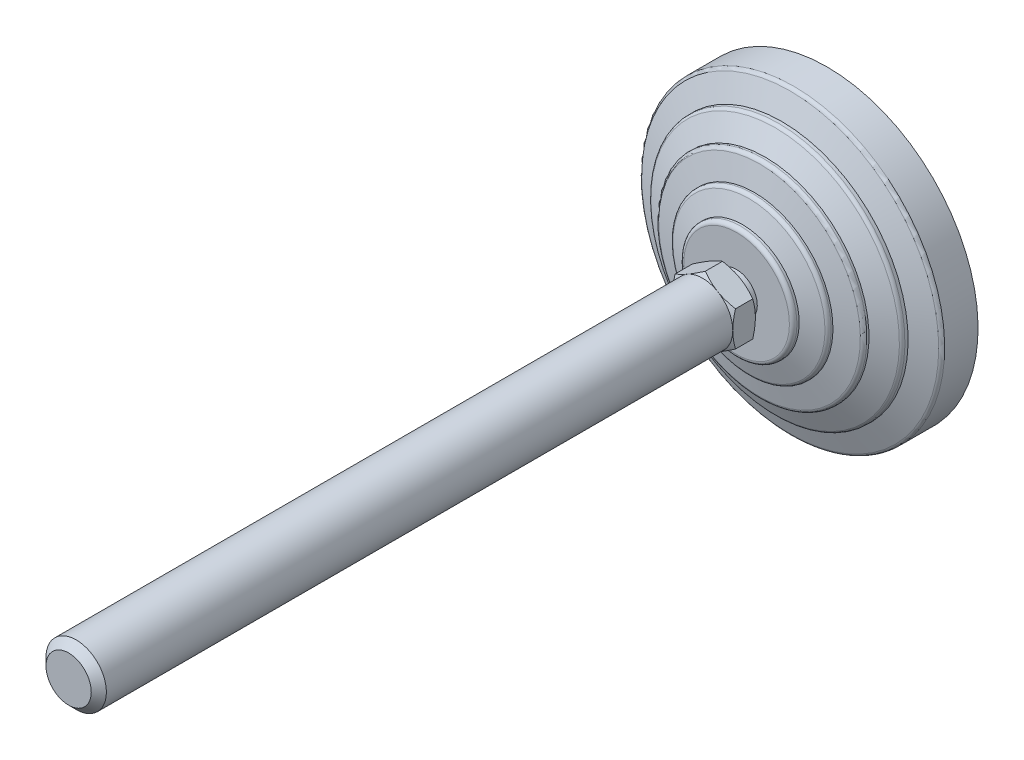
ISO-10303-21;
HEADER;
FILE_DESCRIPTION(('STEP AP214'),'2;1');
FILE_NAME('part.step','',(''),(''),'','','');
FILE_SCHEMA(('AUTOMOTIVE_DESIGN { 1 0 10303 214 1 1 1 1 }'));
ENDSEC;
DATA;
#1=APPLICATION_CONTEXT('core data for automotive mechanical design processes');
#2=APPLICATION_PROTOCOL_DEFINITION('international standard','automotive_design',2000,#1);
#3=PRODUCT_CONTEXT('',#1,'mechanical');
#4=PRODUCT('Part','Part','',(#3));
#5=PRODUCT_RELATED_PRODUCT_CATEGORY('part','',(#4));
#6=PRODUCT_DEFINITION_FORMATION('','',#4);
#7=PRODUCT_DEFINITION_CONTEXT('part definition',#1,'design');
#8=PRODUCT_DEFINITION('design','',#6,#7);
#9=PRODUCT_DEFINITION_SHAPE('','',#8);
#10=(LENGTH_UNIT() NAMED_UNIT(*) SI_UNIT(.MILLI.,.METRE.));
#11=(NAMED_UNIT(*) PLANE_ANGLE_UNIT() SI_UNIT($,.RADIAN.));
#12=(NAMED_UNIT(*) SI_UNIT($,.STERADIAN.) SOLID_ANGLE_UNIT());
#13=UNCERTAINTY_MEASURE_WITH_UNIT(LENGTH_MEASURE(1.E-05),#10,'distance_accuracy_value','');
#14=(GEOMETRIC_REPRESENTATION_CONTEXT(3) GLOBAL_UNCERTAINTY_ASSIGNED_CONTEXT((#13)) GLOBAL_UNIT_ASSIGNED_CONTEXT((#10,
#11,#12)) REPRESENTATION_CONTEXT('',''));
#15=CARTESIAN_POINT('',(0.,0.,0.));
#16=DIRECTION('',(0.,0.,1.));
#17=DIRECTION('',(1.,0.,0.));
#18=AXIS2_PLACEMENT_3D('',#15,#16,#17);
#19=CARTESIAN_POINT('',(-33.5,0.,3.));
#20=DIRECTION('',(0.,0.,1.));
#21=DIRECTION('',(0.,-1.,0.));
#22=AXIS2_PLACEMENT_3D('',#19,#20,#21);
#23=PLANE('',#22);
#24=CARTESIAN_POINT('',(0.,0.,3.));
#25=DIRECTION('',(0.,0.,-1.));
#26=DIRECTION('',(0.,1.,0.));
#27=AXIS2_PLACEMENT_3D('',#24,#25,#26);
#28=CIRCLE('',#27,33.5);
#29=CARTESIAN_POINT('',(0.,33.5,3.));
#30=VERTEX_POINT('',#29);
#31=EDGE_CURVE('E332',#30,#30,#28,.T.);
#32=ORIENTED_EDGE('',*,*,#31,.F.);
#33=EDGE_LOOP('',(#32));
#34=FACE_BOUND('',#33,.T.);
#35=CARTESIAN_POINT('',(0.,0.,3.));
#36=DIRECTION('',(0.,0.,-1.));
#37=DIRECTION('',(0.,1.,0.));
#38=AXIS2_PLACEMENT_3D('',#35,#36,#37);
#39=CIRCLE('',#38,40.);
#40=CARTESIAN_POINT('',(0.,40.,3.));
#41=VERTEX_POINT('',#40);
#42=EDGE_CURVE('E394',#41,#41,#39,.T.);
#43=ORIENTED_EDGE('',*,*,#42,.T.);
#44=EDGE_LOOP('',(#43));
#45=FACE_BOUND('',#44,.T.);
#46=ADVANCED_FACE('F14',(#34,#45),#23,.F.);
#47=CARTESIAN_POINT('',(0.,0.,0.));
#48=DIRECTION('',(0.,0.,-1.));
#49=DIRECTION('',(0.,1.,0.));
#50=AXIS2_PLACEMENT_3D('',#47,#48,#49);
#51=CYLINDRICAL_SURFACE('',#50,33.5);
#52=CARTESIAN_POINT('',(0.,0.,0.));
#53=DIRECTION('',(0.,0.,-1.));
#54=DIRECTION('',(0.,1.,0.));
#55=AXIS2_PLACEMENT_3D('',#52,#53,#54);
#56=CIRCLE('',#55,33.5);
#57=CARTESIAN_POINT('',(0.,33.5,0.));
#58=VERTEX_POINT('',#57);
#59=EDGE_CURVE('E329',#58,#58,#56,.T.);
#60=ORIENTED_EDGE('',*,*,#59,.F.);
#61=EDGE_LOOP('',(#60));
#62=FACE_BOUND('',#61,.T.);
#63=ORIENTED_EDGE('',*,*,#31,.T.);
#64=EDGE_LOOP('',(#63));
#65=FACE_BOUND('',#64,.T.);
#66=ADVANCED_FACE('F316',(#62,#65),#51,.T.);
#67=CARTESIAN_POINT('',(0.,0.,0.));
#68=DIRECTION('',(0.,0.,1.));
#69=DIRECTION('',(0.,-1.,0.));
#70=AXIS2_PLACEMENT_3D('',#67,#68,#69);
#71=PLANE('',#70);
#72=ORIENTED_EDGE('',*,*,#59,.T.);
#73=EDGE_LOOP('',(#72));
#74=FACE_BOUND('',#73,.T.);
#75=ADVANCED_FACE('F300',(#74),#71,.F.);
#76=CARTESIAN_POINT('',(-7.7647058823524,0.,30.));
#77=DIRECTION('',(0.,0.,1.));
#78=DIRECTION('',(0.,-1.,0.));
#79=AXIS2_PLACEMENT_3D('',#76,#77,#78);
#80=PLANE('',#79);
#81=CARTESIAN_POINT('',(0.,0.,30.));
#82=DIRECTION('',(0.,0.,-1.));
#83=DIRECTION('',(0.,1.,0.));
#84=AXIS2_PLACEMENT_3D('',#81,#82,#83);
#85=CIRCLE('',#84,5.50000000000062);
#86=CARTESIAN_POINT('',(0.,5.50000000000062,30.));
#87=VERTEX_POINT('',#86);
#88=EDGE_CURVE('E346',#87,#87,#85,.T.);
#89=ORIENTED_EDGE('',*,*,#88,.F.);
#90=EDGE_LOOP('',(#89));
#91=FACE_BOUND('',#90,.T.);
#92=CARTESIAN_POINT('',(0.,0.,30.));
#93=DIRECTION('',(0.,0.,-1.));
#94=DIRECTION('',(-1.,0.,0.));
#95=AXIS2_PLACEMENT_3D('',#92,#93,#94);
#96=CIRCLE('',#95,8.00000000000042);
#97=CARTESIAN_POINT('',(4.,6.92820323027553,30.));
#98=VERTEX_POINT('',#97);
#99=CARTESIAN_POINT('',(8.,0.,30.));
#100=VERTEX_POINT('',#99);
#101=EDGE_CURVE('E491',#98,#100,#96,.T.);
#102=ORIENTED_EDGE('',*,*,#101,.T.);
#103=CARTESIAN_POINT('',(4.,-6.92820323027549,30.));
#104=VERTEX_POINT('',#103);
#105=EDGE_CURVE('E140',#100,#104,#96,.T.);
#106=ORIENTED_EDGE('',*,*,#105,.T.);
#107=CARTESIAN_POINT('',(-4.,-6.92820323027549,30.));
#108=VERTEX_POINT('',#107);
#109=EDGE_CURVE('E139',#104,#108,#96,.T.);
#110=ORIENTED_EDGE('',*,*,#109,.T.);
#111=CARTESIAN_POINT('',(-8.,0.,30.));
#112=VERTEX_POINT('',#111);
#113=EDGE_CURVE('E116',#108,#112,#96,.T.);
#114=ORIENTED_EDGE('',*,*,#113,.T.);
#115=CARTESIAN_POINT('',(-4.,6.92820323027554,30.));
#116=VERTEX_POINT('',#115);
#117=EDGE_CURVE('E104',#112,#116,#96,.T.);
#118=ORIENTED_EDGE('',*,*,#117,.T.);
#119=EDGE_CURVE('E33',#116,#98,#96,.T.);
#120=ORIENTED_EDGE('',*,*,#119,.T.);
#121=EDGE_LOOP('',(#102,#106,#110,#114,#118,#120));
#122=FACE_BOUND('',#121,.T.);
#123=ADVANCED_FACE('F137',(#91,#122),#80,.F.);
#124=CARTESIAN_POINT('',(0.,0.,0.));
#125=DIRECTION('',(0.,0.,-1.));
#126=DIRECTION('',(0.,1.,0.));
#127=AXIS2_PLACEMENT_3D('',#124,#125,#126);
#128=CYLINDRICAL_SURFACE('',#127,5.50000000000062);
#129=CARTESIAN_POINT('',(0.,0.,27.));
#130=DIRECTION('',(0.,0.,-1.));
#131=DIRECTION('',(0.,1.,0.));
#132=AXIS2_PLACEMENT_3D('',#129,#130,#131);
#133=CIRCLE('',#132,5.50000000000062);
#134=CARTESIAN_POINT('',(0.,5.50000000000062,27.));
#135=VERTEX_POINT('',#134);
#136=EDGE_CURVE('E349',#135,#135,#133,.T.);
#137=ORIENTED_EDGE('',*,*,#136,.F.);
#138=EDGE_LOOP('',(#137));
#139=FACE_BOUND('',#138,.T.);
#140=ORIENTED_EDGE('',*,*,#88,.T.);
#141=EDGE_LOOP('',(#140));
#142=FACE_BOUND('',#141,.T.);
#143=ADVANCED_FACE('F293',(#139,#142),#128,.T.);
#144=CARTESIAN_POINT('',(-5.50000000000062,0.,27.));
#145=DIRECTION('',(0.,0.,-1.));
#146=DIRECTION('',(0.,1.,0.));
#147=AXIS2_PLACEMENT_3D('',#144,#145,#146);
#148=PLANE('',#147);
#149=CARTESIAN_POINT('',(0.,0.,27.));
#150=DIRECTION('',(0.,0.,-1.));
#151=DIRECTION('',(0.,1.,0.));
#152=AXIS2_PLACEMENT_3D('',#149,#150,#151);
#153=CIRCLE('',#152,14.);
#154=CARTESIAN_POINT('',(0.,14.,27.));
#155=VERTEX_POINT('',#154);
#156=EDGE_CURVE('E352',#155,#155,#153,.T.);
#157=ORIENTED_EDGE('',*,*,#156,.F.);
#158=EDGE_LOOP('',(#157));
#159=FACE_BOUND('',#158,.T.);
#160=ORIENTED_EDGE('',*,*,#136,.T.);
#161=EDGE_LOOP('',(#160));
#162=FACE_BOUND('',#161,.T.);
#163=ADVANCED_FACE('F289',(#159,#162),#148,.F.);
#164=CARTESIAN_POINT('',(0.,0.,26.));
#165=DIRECTION('',(0.,0.,-1.));
#166=DIRECTION('',(0.,1.,0.));
#167=AXIS2_PLACEMENT_3D('',#164,#165,#166);
#168=TOROIDAL_SURFACE('',#167,14.,1.);
#169=CARTESIAN_POINT('',(0.,0.,26.));
#170=DIRECTION('',(0.,0.,-1.));
#171=DIRECTION('',(0.,1.,0.));
#172=AXIS2_PLACEMENT_3D('',#169,#170,#171);
#173=CIRCLE('',#172,15.);
#174=CARTESIAN_POINT('',(0.,15.,26.));
#175=VERTEX_POINT('',#174);
#176=EDGE_CURVE('E355',#175,#175,#173,.T.);
#177=ORIENTED_EDGE('',*,*,#176,.F.);
#178=EDGE_LOOP('',(#177));
#179=FACE_BOUND('',#178,.T.);
#180=ORIENTED_EDGE('',*,*,#156,.T.);
#181=EDGE_LOOP('',(#180));
#182=FACE_BOUND('',#181,.T.);
#183=ADVANCED_FACE('F285',(#179,#182),#168,.T.);
#184=CARTESIAN_POINT('',(0.,0.,0.));
#185=DIRECTION('',(0.,0.,-1.));
#186=DIRECTION('',(0.,1.,0.));
#187=AXIS2_PLACEMENT_3D('',#184,#185,#186);
#188=CYLINDRICAL_SURFACE('',#187,15.);
#189=CARTESIAN_POINT('',(0.,0.,25.4025287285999));
#190=DIRECTION('',(0.,0.,-1.));
#191=DIRECTION('',(0.,1.,0.));
#192=AXIS2_PLACEMENT_3D('',#189,#190,#191);
#193=CIRCLE('',#192,15.);
#194=CARTESIAN_POINT('',(0.,15.,25.4025287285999));
#195=VERTEX_POINT('',#194);
#196=EDGE_CURVE('E358',#195,#195,#193,.T.);
#197=ORIENTED_EDGE('',*,*,#196,.F.);
#198=EDGE_LOOP('',(#197));
#199=FACE_BOUND('',#198,.T.);
#200=ORIENTED_EDGE('',*,*,#176,.T.);
#201=EDGE_LOOP('',(#200));
#202=FACE_BOUND('',#201,.T.);
#203=ADVANCED_FACE('F281',(#199,#202),#188,.T.);
#204=CARTESIAN_POINT('',(0.,0.,25.4025287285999));
#205=DIRECTION('',(0.,0.,-1.));
#206=DIRECTION('',(0.,1.,0.));
#207=AXIS2_PLACEMENT_3D('',#204,#205,#206);
#208=CONICAL_SURFACE('',#207,15.,1.25589726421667);
#209=CARTESIAN_POINT('',(0.,0.,23.7216684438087));
#210=DIRECTION('',(0.,0.,-1.));
#211=DIRECTION('',(0.,1.,0.));
#212=AXIS2_PLACEMENT_3D('',#209,#210,#211);
#213=CIRCLE('',#212,20.16016354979);
#214=CARTESIAN_POINT('',(0.,20.16016354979,23.7216684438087));
#215=VERTEX_POINT('',#214);
#216=EDGE_CURVE('E361',#215,#215,#213,.T.);
#217=ORIENTED_EDGE('',*,*,#216,.F.);
#218=EDGE_LOOP('',(#217));
#219=FACE_BOUND('',#218,.T.);
#220=ORIENTED_EDGE('',*,*,#196,.T.);
#221=EDGE_LOOP('',(#220));
#222=FACE_BOUND('',#221,.T.);
#223=ADVANCED_FACE('F277',(#219,#222),#208,.T.);
#224=CARTESIAN_POINT('',(0.,0.,22.7708407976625));
#225=DIRECTION('',(0.,0.,-1.));
#226=DIRECTION('',(0.,1.,0.));
#227=AXIS2_PLACEMENT_3D('',#224,#225,#226);
#228=TOROIDAL_SURFACE('',#227,19.8504430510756,1.);
#229=CARTESIAN_POINT('',(0.,0.,22.7708407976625));
#230=DIRECTION('',(0.,0.,-1.));
#231=DIRECTION('',(0.,1.,0.));
#232=AXIS2_PLACEMENT_3D('',#229,#230,#231);
#233=CIRCLE('',#232,20.8504430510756);
#234=CARTESIAN_POINT('',(0.,20.8504430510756,22.7708407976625));
#235=VERTEX_POINT('',#234);
#236=EDGE_CURVE('E364',#235,#235,#233,.T.);
#237=ORIENTED_EDGE('',*,*,#236,.F.);
#238=EDGE_LOOP('',(#237));
#239=FACE_BOUND('',#238,.T.);
#240=ORIENTED_EDGE('',*,*,#216,.T.);
#241=EDGE_LOOP('',(#240));
#242=FACE_BOUND('',#241,.T.);
#243=ADVANCED_FACE('F273',(#239,#242),#228,.T.);
#244=CARTESIAN_POINT('',(0.,0.,0.));
#245=DIRECTION('',(0.,0.,-1.));
#246=DIRECTION('',(0.,1.,0.));
#247=AXIS2_PLACEMENT_3D('',#244,#245,#246);
#248=CYLINDRICAL_SURFACE('',#247,20.8504430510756);
#249=CARTESIAN_POINT('',(0.,0.,22.2987385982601));
#250=DIRECTION('',(0.,0.,-1.));
#251=DIRECTION('',(0.,1.,0.));
#252=AXIS2_PLACEMENT_3D('',#249,#250,#251);
#253=CIRCLE('',#252,20.8504430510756);
#254=CARTESIAN_POINT('',(0.,20.8504430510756,22.2987385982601));
#255=VERTEX_POINT('',#254);
#256=EDGE_CURVE('E367',#255,#255,#253,.T.);
#257=ORIENTED_EDGE('',*,*,#256,.F.);
#258=EDGE_LOOP('',(#257));
#259=FACE_BOUND('',#258,.T.);
#260=ORIENTED_EDGE('',*,*,#236,.T.);
#261=EDGE_LOOP('',(#260));
#262=FACE_BOUND('',#261,.T.);
#263=ADVANCED_FACE('F269',(#259,#262),#248,.T.);
#264=CARTESIAN_POINT('',(0.,0.,22.2987385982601));
#265=DIRECTION('',(0.,0.,-1.));
#266=DIRECTION('',(0.,1.,0.));
#267=AXIS2_PLACEMENT_3D('',#264,#265,#266);
#268=CONICAL_SURFACE('',#267,20.8504430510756,1.34067144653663);
#269=CARTESIAN_POINT('',(0.,0.,20.9217501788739));
#270=DIRECTION('',(0.,0.,-1.));
#271=DIRECTION('',(0.,1.,0.));
#272=AXIS2_PLACEMENT_3D('',#269,#270,#271);
#273=CIRCLE('',#272,26.7280991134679);
#274=CARTESIAN_POINT('',(0.,26.7280991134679,20.9217501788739));
#275=VERTEX_POINT('',#274);
#276=EDGE_CURVE('E370',#275,#275,#273,.T.);
#277=ORIENTED_EDGE('',*,*,#276,.F.);
#278=EDGE_LOOP('',(#277));
#279=FACE_BOUND('',#278,.T.);
#280=ORIENTED_EDGE('',*,*,#256,.T.);
#281=EDGE_LOOP('',(#280));
#282=FACE_BOUND('',#281,.T.);
#283=ADVANCED_FACE('F265',(#279,#282),#268,.T.);
#284=CARTESIAN_POINT('',(0.,0.,19.9481122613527));
#285=DIRECTION('',(0.,0.,-1.));
#286=DIRECTION('',(0.,1.,0.));
#287=AXIS2_PLACEMENT_3D('',#284,#285,#286);
#288=TOROIDAL_SURFACE('',#287,26.5,1.);
#289=CARTESIAN_POINT('',(0.,0.,19.9481122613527));
#290=DIRECTION('',(0.,0.,-1.));
#291=DIRECTION('',(0.,1.,0.));
#292=AXIS2_PLACEMENT_3D('',#289,#290,#291);
#293=CIRCLE('',#292,27.5);
#294=CARTESIAN_POINT('',(0.,27.5,19.9481122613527));
#295=VERTEX_POINT('',#294);
#296=EDGE_CURVE('E373',#295,#295,#293,.T.);
#297=ORIENTED_EDGE('',*,*,#296,.F.);
#298=EDGE_LOOP('',(#297));
#299=FACE_BOUND('',#298,.T.);
#300=ORIENTED_EDGE('',*,*,#276,.T.);
#301=EDGE_LOOP('',(#300));
#302=FACE_BOUND('',#301,.T.);
#303=ADVANCED_FACE('F261',(#299,#302),#288,.T.);
#304=CARTESIAN_POINT('',(0.,0.,0.));
#305=DIRECTION('',(0.,0.,-1.));
#306=DIRECTION('',(0.,1.,0.));
#307=AXIS2_PLACEMENT_3D('',#304,#305,#306);
#308=CYLINDRICAL_SURFACE('',#307,27.5);
#309=CARTESIAN_POINT('',(0.,0.,19.4025287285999));
#310=DIRECTION('',(0.,0.,-1.));
#311=DIRECTION('',(0.,1.,0.));
#312=AXIS2_PLACEMENT_3D('',#309,#310,#311);
#313=CIRCLE('',#312,27.5);
#314=CARTESIAN_POINT('',(0.,27.5,19.4025287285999));
#315=VERTEX_POINT('',#314);
#316=EDGE_CURVE('E376',#315,#315,#313,.T.);
#317=ORIENTED_EDGE('',*,*,#316,.F.);
#318=EDGE_LOOP('',(#317));
#319=FACE_BOUND('',#318,.T.);
#320=ORIENTED_EDGE('',*,*,#296,.T.);
#321=EDGE_LOOP('',(#320));
#322=FACE_BOUND('',#321,.T.);
#323=ADVANCED_FACE('F257',(#319,#322),#308,.T.);
#324=CARTESIAN_POINT('',(0.,0.,19.4025287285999));
#325=DIRECTION('',(0.,0.,-1.));
#326=DIRECTION('',(0.,1.,0.));
#327=AXIS2_PLACEMENT_3D('',#324,#325,#326);
#328=CONICAL_SURFACE('',#327,27.5,1.1202291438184);
#329=CARTESIAN_POINT('',(0.,0.,16.7730910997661));
#330=DIRECTION('',(0.,0.,-1.));
#331=DIRECTION('',(0.,1.,0.));
#332=AXIS2_PLACEMENT_3D('',#329,#330,#331);
#333=CIRCLE('',#332,32.9354761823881);
#334=CARTESIAN_POINT('',(0.,32.9354761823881,16.7730910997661));
#335=VERTEX_POINT('',#334);
#336=EDGE_CURVE('E379',#335,#335,#333,.T.);
#337=ORIENTED_EDGE('',*,*,#336,.F.);
#338=EDGE_LOOP('',(#337));
#339=FACE_BOUND('',#338,.T.);
#340=ORIENTED_EDGE('',*,*,#316,.T.);
#341=EDGE_LOOP('',(#340));
#342=FACE_BOUND('',#341,.T.);
#343=ADVANCED_FACE('F253',(#339,#342),#328,.T.);
#344=CARTESIAN_POINT('',(0.,0.,15.8728908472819));
#345=DIRECTION('',(0.,0.,-1.));
#346=DIRECTION('',(0.,1.,0.));
#347=AXIS2_PLACEMENT_3D('',#344,#345,#346);
#348=TOROIDAL_SURFACE('',#347,32.5,0.999999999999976);
#349=CARTESIAN_POINT('',(0.,0.,15.8728908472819));
#350=DIRECTION('',(0.,0.,-1.));
#351=DIRECTION('',(0.,1.,0.));
#352=AXIS2_PLACEMENT_3D('',#349,#350,#351);
#353=CIRCLE('',#352,33.5);
#354=CARTESIAN_POINT('',(0.,33.5,15.8728908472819));
#355=VERTEX_POINT('',#354);
#356=EDGE_CURVE('E382',#355,#355,#353,.T.);
#357=ORIENTED_EDGE('',*,*,#356,.F.);
#358=EDGE_LOOP('',(#357));
#359=FACE_BOUND('',#358,.T.);
#360=ORIENTED_EDGE('',*,*,#336,.T.);
#361=EDGE_LOOP('',(#360));
#362=FACE_BOUND('',#361,.T.);
#363=ADVANCED_FACE('F249',(#359,#362),#348,.T.);
#364=CARTESIAN_POINT('',(0.,0.,0.));
#365=DIRECTION('',(0.,0.,-1.));
#366=DIRECTION('',(0.,1.,0.));
#367=AXIS2_PLACEMENT_3D('',#364,#365,#366);
#368=CYLINDRICAL_SURFACE('',#367,33.5);
#369=CARTESIAN_POINT('',(0.,0.,15.0315037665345));
#370=DIRECTION('',(0.,0.,-1.));
#371=DIRECTION('',(0.,1.,0.));
#372=AXIS2_PLACEMENT_3D('',#369,#370,#371);
#373=CIRCLE('',#372,33.5);
#374=CARTESIAN_POINT('',(0.,33.5,15.0315037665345));
#375=VERTEX_POINT('',#374);
#376=EDGE_CURVE('E385',#375,#375,#373,.T.);
#377=ORIENTED_EDGE('',*,*,#376,.F.);
#378=EDGE_LOOP('',(#377));
#379=FACE_BOUND('',#378,.T.);
#380=ORIENTED_EDGE('',*,*,#356,.T.);
#381=EDGE_LOOP('',(#380));
#382=FACE_BOUND('',#381,.T.);
#383=ADVANCED_FACE('F245',(#379,#382),#368,.T.);
#384=CARTESIAN_POINT('',(0.,0.,15.0315037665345));
#385=DIRECTION('',(0.,0.,-1.));
#386=DIRECTION('',(0.,1.,0.));
#387=AXIS2_PLACEMENT_3D('',#384,#385,#386);
#388=CONICAL_SURFACE('',#387,33.5,1.20362249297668);
#389=CARTESIAN_POINT('',(0.,0.,12.7780502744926));
#390=DIRECTION('',(0.,0.,-1.));
#391=DIRECTION('',(0.,1.,0.));
#392=AXIS2_PLACEMENT_3D('',#389,#390,#391);
#393=CIRCLE('',#392,39.3589790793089);
#394=CARTESIAN_POINT('',(0.,39.3589790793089,12.7780502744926));
#395=VERTEX_POINT('',#394);
#396=EDGE_CURVE('E388',#395,#395,#393,.T.);
#397=ORIENTED_EDGE('',*,*,#396,.F.);
#398=EDGE_LOOP('',(#397));
#399=FACE_BOUND('',#398,.T.);
#400=ORIENTED_EDGE('',*,*,#376,.T.);
#401=EDGE_LOOP('',(#400));
#402=FACE_BOUND('',#401,.T.);
#403=ADVANCED_FACE('F241',(#399,#402),#388,.T.);
#404=CARTESIAN_POINT('',(0.,0.,11.8447046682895));
#405=DIRECTION('',(0.,0.,-1.));
#406=DIRECTION('',(0.,1.,0.));
#407=AXIS2_PLACEMENT_3D('',#404,#405,#406);
#408=TOROIDAL_SURFACE('',#407,39.,1.00000000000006);
#409=CARTESIAN_POINT('',(0.,0.,11.8447046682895));
#410=DIRECTION('',(0.,0.,-1.));
#411=DIRECTION('',(0.,1.,0.));
#412=AXIS2_PLACEMENT_3D('',#409,#410,#411);
#413=CIRCLE('',#412,40.);
#414=CARTESIAN_POINT('',(0.,40.,11.8447046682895));
#415=VERTEX_POINT('',#414);
#416=EDGE_CURVE('E391',#415,#415,#413,.T.);
#417=ORIENTED_EDGE('',*,*,#416,.F.);
#418=EDGE_LOOP('',(#417));
#419=FACE_BOUND('',#418,.T.);
#420=ORIENTED_EDGE('',*,*,#396,.T.);
#421=EDGE_LOOP('',(#420));
#422=FACE_BOUND('',#421,.T.);
#423=ADVANCED_FACE('F237',(#419,#422),#408,.T.);
#424=CARTESIAN_POINT('',(0.,0.,0.));
#425=DIRECTION('',(0.,0.,-1.));
#426=DIRECTION('',(0.,1.,0.));
#427=AXIS2_PLACEMENT_3D('',#424,#425,#426);
#428=CYLINDRICAL_SURFACE('',#427,40.);
#429=ORIENTED_EDGE('',*,*,#42,.F.);
#430=EDGE_LOOP('',(#429));
#431=FACE_BOUND('',#430,.T.);
#432=ORIENTED_EDGE('',*,*,#416,.T.);
#433=EDGE_LOOP('',(#432));
#434=FACE_BOUND('',#433,.T.);
#435=ADVANCED_FACE('F233',(#431,#434),#428,.T.);
#436=CARTESIAN_POINT('',(0.,0.,31.2132020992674));
#437=DIRECTION('',(0.,0.,1.));
#438=DIRECTION('',(1.,0.,0.));
#439=AXIS2_PLACEMENT_3D('',#436,#437,#438);
#440=CONICAL_SURFACE('',#439,10.1013276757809,1.04719755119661);
#441=CARTESIAN_POINT('',(8.,-12.319045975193,33.8617421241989));
#442=CARTESIAN_POINT('',(8.,-11.9703620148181,33.692953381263));
#443=CARTESIAN_POINT('',(7.99999999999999,-11.6208681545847,33.5258086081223));
#444=CARTESIAN_POINT('',(7.99999999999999,-10.9198295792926,33.1957334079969));
#445=CARTESIAN_POINT('',(7.99999999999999,-10.5682845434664,33.0328036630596));
#446=CARTESIAN_POINT('',(7.99999999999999,-9.86085882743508,32.7112463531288));
#447=CARTESIAN_POINT('',(7.99999999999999,-9.50496490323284,32.5526478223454));
#448=CARTESIAN_POINT('',(7.99999999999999,-8.79031562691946,32.2420592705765));
#449=CARTESIAN_POINT('',(7.99999999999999,-8.43156041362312,32.0900689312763));
#450=CARTESIAN_POINT('',(7.99999999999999,-7.69937388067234,31.7898338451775));
#451=CARTESIAN_POINT('',(7.99999999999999,-7.32583358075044,31.6418533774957));
#452=CARTESIAN_POINT('',(7.99999999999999,-6.57435144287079,31.3573058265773));
#453=CARTESIAN_POINT('',(8.,-6.19640911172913,31.2207400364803));
#454=CARTESIAN_POINT('',(8.,-5.43625330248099,30.9626718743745));
#455=CARTESIAN_POINT('',(7.99999999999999,-5.05405055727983,30.8411382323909));
#456=CARTESIAN_POINT('',(8.,-4.28417766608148,30.6170900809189));
#457=CARTESIAN_POINT('',(8.,-3.89650931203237,30.5145694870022));
#458=CARTESIAN_POINT('',(8.,-3.1175585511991,30.3340732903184));
#459=CARTESIAN_POINT('',(8.,-2.72630711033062,30.255967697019));
#460=CARTESIAN_POINT('',(8.,-2.13593823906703,30.1605444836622));
#461=CARTESIAN_POINT('',(8.,-1.93855145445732,30.1323579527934));
#462=CARTESIAN_POINT('',(8.,-1.54282687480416,30.0837847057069));
#463=CARTESIAN_POINT('',(8.,-1.34448917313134,30.0633972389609));
#464=CARTESIAN_POINT('',(8.,-0.949680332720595,30.0310794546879));
#465=CARTESIAN_POINT('',(8.,-0.753217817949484,30.0190441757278));
#466=CARTESIAN_POINT('',(8.,-0.35996025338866,30.0032860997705));
#467=CARTESIAN_POINT('',(8.,-0.163165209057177,29.9995631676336));
#468=CARTESIAN_POINT('',(8.,0.230406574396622,30.000518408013));
#469=CARTESIAN_POINT('',(8.,0.427183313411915,30.0051966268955));
#470=CARTESIAN_POINT('',(8.,0.820367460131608,30.022841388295));
#471=CARTESIAN_POINT('',(8.,1.01677484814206,30.0358083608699));
#472=CARTESIAN_POINT('',(8.,1.49150162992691,30.0768962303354));
#473=CARTESIAN_POINT('',(8.,1.76947485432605,30.1090996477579));
#474=CARTESIAN_POINT('',(8.,2.32328695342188,30.1883314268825));
#475=CARTESIAN_POINT('',(8.,2.59912552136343,30.2353618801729));
#476=CARTESIAN_POINT('',(8.,3.42316469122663,30.3961937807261));
#477=CARTESIAN_POINT('',(8.,3.96756552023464,30.5297041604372));
#478=CARTESIAN_POINT('',(8.,4.78145512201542,30.7603174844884));
#479=CARTESIAN_POINT('',(8.,5.0551882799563,30.8432948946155));
#480=CARTESIAN_POINT('',(8.,5.59999461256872,31.0176430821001));
#481=CARTESIAN_POINT('',(8.,5.87106777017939,31.1090139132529));
#482=CARTESIAN_POINT('',(8.,6.41064356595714,31.2987017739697));
#483=CARTESIAN_POINT('',(8.,6.67914707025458,31.397016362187));
#484=CARTESIAN_POINT('',(8.,7.21394495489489,31.5994575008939));
#485=CARTESIAN_POINT('',(8.,7.48023935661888,31.7035839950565));
#486=CARTESIAN_POINT('',(8.,8.08939205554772,31.9482157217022));
#487=CARTESIAN_POINT('',(8.,8.43158760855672,32.0903677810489));
#488=CARTESIAN_POINT('',(8.,9.11322132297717,32.3811528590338));
#489=CARTESIAN_POINT('',(8.,9.45265934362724,32.5297862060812));
#490=CARTESIAN_POINT('',(8.,10.1292668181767,32.8322879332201));
#491=CARTESIAN_POINT('',(8.,10.4664358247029,32.9861573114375));
#492=CARTESIAN_POINT('',(8.,11.1388032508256,33.2981192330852));
#493=CARTESIAN_POINT('',(8.,11.4740017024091,33.4562117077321));
#494=CARTESIAN_POINT('',(8.,12.1430450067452,33.776003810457));
#495=CARTESIAN_POINT('',(8.,12.4768883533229,33.9377065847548));
#496=CARTESIAN_POINT('',(8.,13.1431684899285,34.2639868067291));
#497=CARTESIAN_POINT('',(8.,13.4756052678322,34.4285642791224));
#498=CARTESIAN_POINT('',(8.,14.4711442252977,34.9258781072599));
#499=CARTESIAN_POINT('',(8.,15.1324614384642,35.262189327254));
#500=CARTESIAN_POINT('',(8.,16.0957007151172,35.7583044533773));
#501=CARTESIAN_POINT('',(8.00000000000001,16.3990087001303,35.9154342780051));
#502=CARTESIAN_POINT('',(8.00000000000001,17.0049629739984,36.2309532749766));
#503=CARTESIAN_POINT('',(8.00000000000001,17.3076092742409,36.3893424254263));
#504=CARTESIAN_POINT('',(8.00000000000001,18.2147097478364,36.8661590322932));
#505=CARTESIAN_POINT('',(8.00000000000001,18.8183030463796,37.1862240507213));
#506=CARTESIAN_POINT('',(8.00000000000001,20.0223339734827,37.8289727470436));
#507=CARTESIAN_POINT('',(8.00000000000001,20.622775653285,38.1516488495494));
#508=CARTESIAN_POINT('',(8.00000000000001,21.822191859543,38.799645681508));
#509=CARTESIAN_POINT('',(8.00000000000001,22.4211664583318,39.1249662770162));
#510=CARTESIAN_POINT('',(8.,23.0195952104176,39.4512815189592));
#511=B_SPLINE_CURVE_WITH_KNOTS('',3,(#441,#442,#443,#444,#445,#446,#447,#448,#449,#450,#451,
#452,#453,#454,#455,#456,#457,#458,#459,#460,#461,#462,#463,#464,#465,#466,#467,#468,#469,#470,
#471,#472,#473,#474,#475,#476,#477,#478,#479,#480,#481,#482,#483,#484,#485,#486,#487,#488,#489,
#490,#491,#492,#493,#494,#495,#496,#497,#498,#499,#500,#501,#502,#503,#504,#505,#506,#507,#508,
#509,#510),.UNSPECIFIED.,.F.,.F.,(4,2,2,2,2,2,2,2,2,2,2,2,2,2,2,2,2,2,2,2,2,2,2,2,2,2,2,2,2,2,2,
2,2,2,4),(0.,1.16218126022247,2.32454941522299,3.49339503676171,4.66218429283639,
5.86739232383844,7.07273670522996,8.27552997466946,9.47793766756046,10.6738299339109,
11.2718674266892,11.8698473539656,12.4601693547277,13.050481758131,13.6407974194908,
14.2311437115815,15.070164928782,15.9093045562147,17.5885538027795,18.4465853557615,
19.3046224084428,20.1623592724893,21.0200878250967,22.1316406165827,23.2432497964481,
24.3550720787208,25.4668762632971,26.5796903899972,27.6925140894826,29.9182067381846,
30.9429835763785,31.9677426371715,34.0173365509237,36.0622870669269,38.1071346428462),.UNSPECIFIED.);
#512=CARTESIAN_POINT('',(8.,4.61880215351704,30.7145311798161));
#513=VERTEX_POINT('',#512);
#514=EDGE_CURVE('E114',#513,#100,#511,.F.);
#515=ORIENTED_EDGE('',*,*,#514,.T.);
#516=ORIENTED_EDGE('',*,*,#101,.F.);
#517=CARTESIAN_POINT('',(-1.07428541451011,9.85784328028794,31.1063226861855));
#518=CARTESIAN_POINT('',(-0.877611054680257,9.74429328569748,31.0288672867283));
#519=CARTESIAN_POINT('',(-0.680148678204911,9.63028832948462,30.9539966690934));
#520=CARTESIAN_POINT('',(-0.283489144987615,9.40127684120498,30.8103544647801));
#521=CARTESIAN_POINT('',(-0.0842913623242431,9.2862699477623,30.7415851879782));
#522=CARTESIAN_POINT('',(0.316682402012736,9.05476763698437,30.6108634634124));
#523=CARTESIAN_POINT('',(0.518465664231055,8.93826801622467,30.5489405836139));
#524=CARTESIAN_POINT('',(0.923786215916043,8.70425608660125,30.4333498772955));
#525=CARTESIAN_POINT('',(1.12732331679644,8.58674388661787,30.379681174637));
#526=CARTESIAN_POINT('',(1.52977023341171,8.35439105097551,30.2832557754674));
#527=CARTESIAN_POINT('',(1.72862825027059,8.23958032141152,30.2402127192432));
#528=CARTESIAN_POINT('',(2.1277526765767,8.00914572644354,30.1639803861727));
#529=CARTESIAN_POINT('',(2.3280189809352,7.89352192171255,30.130790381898));
#530=CARTESIAN_POINT('',(2.72930181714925,7.66184116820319,30.0752242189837));
#531=CARTESIAN_POINT('',(2.93031623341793,7.54578544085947,30.0528278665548));
#532=CARTESIAN_POINT('',(3.33305588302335,7.31326359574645,30.0194401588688));
#533=CARTESIAN_POINT('',(3.53478109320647,7.19679749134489,30.0084484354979));
#534=CARTESIAN_POINT('',(3.92644442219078,6.97067056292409,29.9985284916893));
#535=CARTESIAN_POINT('',(4.11636976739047,6.86101711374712,29.9989214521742));
#536=CARTESIAN_POINT('',(4.49598991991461,6.6418433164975,30.0100948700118));
#537=CARTESIAN_POINT('',(4.68568472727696,6.53232296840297,30.0208753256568));
#538=CARTESIAN_POINT('',(5.06474358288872,6.31347323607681,30.0525412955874));
#539=CARTESIAN_POINT('',(5.25410660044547,6.20414444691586,30.0734431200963));
#540=CARTESIAN_POINT('',(5.63184888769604,5.98605483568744,30.1247882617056));
#541=CARTESIAN_POINT('',(5.82022816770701,5.87729400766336,30.1552314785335));
#542=CARTESIAN_POINT('',(6.3945950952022,5.5456831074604,30.2618325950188));
#543=CARTESIAN_POINT('',(6.77858911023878,5.32398405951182,30.3522611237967));
#544=CARTESIAN_POINT('',(7.53925664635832,4.88481245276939,30.5626422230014));
#545=CARTESIAN_POINT('',(7.91594938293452,4.66732879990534,30.6825011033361));
#546=CARTESIAN_POINT('',(8.28915146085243,4.45186047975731,30.8134807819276));
#547=B_SPLINE_CURVE_WITH_KNOTS('',3,(#517,#518,#519,#520,#521,#522,#523,#524,#525,#526,#527,
#528,#529,#530,#531,#532,#533,#534,#535,#536,#537,#538,#539,#540,#541,#542,#543,#544,#545,#546),
.UNSPECIFIED.,.F.,.F.,(4,2,2,2,2,2,2,2,2,2,2,2,2,2,4),(0.,0.719860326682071,1.4399920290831,
2.16312141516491,2.88617399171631,3.58684404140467,4.28746234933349,4.98676473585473,
5.68604454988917,6.34372019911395,7.00139574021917,7.66013464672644,8.31886663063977,
9.67518633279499,11.027242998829),.UNSPECIFIED.);
#548=EDGE_CURVE('E17',#98,#513,#547,.T.);
#549=ORIENTED_EDGE('',*,*,#548,.T.);
#550=EDGE_LOOP('',(#515,#516,#549));
#551=FACE_BOUND('',#550,.T.);
#552=ADVANCED_FACE('F157',(#551),#440,.T.);
#553=CARTESIAN_POINT('',(-14.4195407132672,0.912478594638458,33.7229756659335));
#554=CARTESIAN_POINT('',(-14.1149285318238,1.08834651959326,33.5539235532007));
#555=CARTESIAN_POINT('',(-13.8095699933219,1.26464535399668,33.3866301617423));
#556=CARTESIAN_POINT('',(-13.1969516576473,1.61834071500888,33.0565799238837));
#557=CARTESIAN_POINT('',(-12.8896915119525,1.79573744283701,32.8938239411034));
#558=CARTESIAN_POINT('',(-12.2710463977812,2.15291236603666,32.5729312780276));
#559=CARTESIAN_POINT('',(-11.9596476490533,2.33269851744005,32.4148298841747));
#560=CARTESIAN_POINT('',(-11.3341946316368,2.69380398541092,32.1058217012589));
#561=CARTESIAN_POINT('',(-11.020140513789,2.87512321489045,31.9549145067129));
#562=CARTESIAN_POINT('',(-10.3861050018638,3.24118378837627,31.6609703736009));
#563=CARTESIAN_POINT('',(-10.0660958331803,3.42594116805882,31.5180128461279));
#564=CARTESIAN_POINT('',(-9.42219761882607,3.79769597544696,31.2440288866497));
#565=CARTESIAN_POINT('',(-9.09830812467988,3.98469366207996,31.1130038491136));
#566=CARTESIAN_POINT('',(-8.44688668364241,4.36079200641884,30.8666551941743));
#567=CARTESIAN_POINT('',(-8.11936527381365,4.54988658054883,30.7512948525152));
#568=CARTESIAN_POINT('',(-7.45966239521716,4.93076621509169,30.5402489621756));
#569=CARTESIAN_POINT('',(-7.12748254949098,5.12255033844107,30.444556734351));
#570=CARTESIAN_POINT('',(-6.46075271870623,5.5074869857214,30.2783914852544));
#571=CARTESIAN_POINT('',(-6.12623613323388,5.70062022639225,30.2077448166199));
#572=CARTESIAN_POINT('',(-5.62173678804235,5.99189305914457,30.1236041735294));
#573=CARTESIAN_POINT('',(-5.45309402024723,6.08925900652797,30.0991937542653));
#574=CARTESIAN_POINT('',(-5.1151066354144,6.2843961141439,30.0581333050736));
#575=CARTESIAN_POINT('',(-4.94576208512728,6.38216723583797,30.041482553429));
#576=CARTESIAN_POINT('',(-4.60753912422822,6.57744035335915,30.016377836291));
#577=CARTESIAN_POINT('',(-4.43866317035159,6.67494093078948,30.0078798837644));
#578=CARTESIAN_POINT('',(-4.10075218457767,6.87003392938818,29.9991170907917));
#579=CARTESIAN_POINT('',(-3.93171715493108,6.96762634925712,29.998852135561));
#580=CARTESIAN_POINT('',(-3.59383020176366,7.16270547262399,30.0065614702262));
#581=CARTESIAN_POINT('',(-3.42497824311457,7.26019219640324,30.0145337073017));
#582=CARTESIAN_POINT('',(-3.08770126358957,7.45491915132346,30.0385292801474));
#583=CARTESIAN_POINT('',(-2.91927626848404,7.5521593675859,30.0545530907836));
#584=CARTESIAN_POINT('',(-2.50292520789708,7.79253976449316,30.1037957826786));
#585=CARTESIAN_POINT('',(-2.25539618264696,7.93545071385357,30.1415707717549));
#586=CARTESIAN_POINT('',(-1.76244835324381,8.22005427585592,30.2323356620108));
#587=CARTESIAN_POINT('',(-1.51702990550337,8.36174668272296,30.285328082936));
#588=CARTESIAN_POINT('',(-0.783425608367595,8.78529332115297,30.4644493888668));
#589=CARTESIAN_POINT('',(-0.298871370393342,9.06505084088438,30.6105921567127));
#590=CARTESIAN_POINT('',(0.425460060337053,9.48324378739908,30.8600773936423));
#591=CARTESIAN_POINT('',(0.669070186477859,9.62389215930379,30.9494051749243));
#592=CARTESIAN_POINT('',(1.15393885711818,9.90383121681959,31.1363490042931));
#593=CARTESIAN_POINT('',(1.3951971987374,10.0431217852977,31.2339657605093));
#594=CARTESIAN_POINT('',(1.87415119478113,10.319646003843,31.4354439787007));
#595=CARTESIAN_POINT('',(2.11185937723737,10.4568868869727,31.5392661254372));
#596=CARTESIAN_POINT('',(2.58529389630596,10.7302244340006,31.7525208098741));
#597=CARTESIAN_POINT('',(2.82102086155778,10.866321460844,31.8619514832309));
#598=CARTESIAN_POINT('',(3.05592006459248,11.0019405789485,31.9736517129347));
#599=B_SPLINE_CURVE_WITH_KNOTS('',3,(#553,#554,#555,#556,#557,#558,#559,#560,#561,#562,#563,
#564,#565,#566,#567,#568,#569,#570,#571,#572,#573,#574,#575,#576,#577,#578,#579,#580,#581,#582,
#583,#584,#585,#586,#587,#588,#589,#590,#591,#592,#593,#594,#595,#596,#597,#598),.UNSPECIFIED.,
.F.,.F.,(4,2,2,2,2,2,2,2,2,2,2,2,2,2,2,2,2,2,2,2,2,2,4),(0.,1.17077377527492,2.34176888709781,
3.52009294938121,4.69835051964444,5.88680475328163,7.0753976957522,8.26115413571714,
9.44650723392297,10.6234733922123,11.2121105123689,11.8006928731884,12.3860814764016,
12.9714619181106,13.5566965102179,14.1419656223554,15.0063899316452,15.8709574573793,
17.6034966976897,18.4888548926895,19.3742888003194,20.2546097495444,21.1346399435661),.UNSPECIFIED.);
#600=CARTESIAN_POINT('',(0.,9.23760430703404,30.7145311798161));
#601=VERTEX_POINT('',#600);
#602=EDGE_CURVE('E149',#116,#601,#599,.T.);
#603=ORIENTED_EDGE('',*,*,#602,.T.);
#604=EDGE_CURVE('E9',#601,#98,#547,.T.);
#605=ORIENTED_EDGE('',*,*,#604,.T.);
#606=ORIENTED_EDGE('',*,*,#119,.F.);
#607=EDGE_LOOP('',(#603,#605,#606));
#608=FACE_BOUND('',#607,.T.);
#609=ADVANCED_FACE('F484',(#608),#440,.T.);
#610=CARTESIAN_POINT('',(-6.42364325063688,-12.9462964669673,33.7252533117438));
#611=CARTESIAN_POINT('',(-6.11905750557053,-12.7704438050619,33.5561953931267));
#612=CARTESIAN_POINT('',(-5.81372608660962,-12.5941606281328,33.3888944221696));
#613=CARTESIAN_POINT('',(-5.20116387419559,-12.2404976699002,33.0588240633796));
#614=CARTESIAN_POINT('',(-4.89393273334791,-12.0631176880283,32.8960555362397));
#615=CARTESIAN_POINT('',(-4.27535221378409,-11.7059800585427,32.5751333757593));
#616=CARTESIAN_POINT('',(-3.96398909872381,-11.5262144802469,32.4170149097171));
#617=CARTESIAN_POINT('',(-3.33861000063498,-11.1651516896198,32.1079635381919));
#618=CARTESIAN_POINT('',(-3.02459416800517,-10.9838545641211,31.9570302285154));
#619=CARTESIAN_POINT('',(-2.39061097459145,-10.617824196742,31.6630086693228));
#620=CARTESIAN_POINT('',(-2.0706155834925,-10.4330747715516,31.5200005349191));
#621=CARTESIAN_POINT('',(-1.42674773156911,-10.0613374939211,31.2459013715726));
#622=CARTESIAN_POINT('',(-1.10287482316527,-9.87434938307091,31.1148117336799));
#623=CARTESIAN_POINT('',(-0.45148701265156,-9.49827045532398,30.8683153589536));
#624=CARTESIAN_POINT('',(-0.123982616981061,-9.30918570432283,30.7528720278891));
#625=CARTESIAN_POINT('',(0.535685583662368,-8.92832609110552,30.5416386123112));
#626=CARTESIAN_POINT('',(0.867847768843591,-8.73655216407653,30.4458418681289));
#627=CARTESIAN_POINT('',(1.53461944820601,-8.35159135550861,30.2794263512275));
#628=CARTESIAN_POINT('',(1.86919657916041,-8.15842315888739,30.2086395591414));
#629=CARTESIAN_POINT('',(2.3737926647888,-7.86709447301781,30.1242844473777));
#630=CARTESIAN_POINT('',(2.54246861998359,-7.76970936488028,30.0998018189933));
#631=CARTESIAN_POINT('',(2.88052471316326,-7.57453258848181,30.0585968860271));
#632=CARTESIAN_POINT('',(3.04990478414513,-7.47674095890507,30.0418738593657));
#633=CARTESIAN_POINT('',(3.38819760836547,-7.28142750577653,30.0166267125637));
#634=CARTESIAN_POINT('',(3.55710788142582,-7.18390711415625,30.0080584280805));
#635=CARTESIAN_POINT('',(3.89509005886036,-6.98877301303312,29.9991577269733));
#636=CARTESIAN_POINT('',(4.06416196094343,-6.89115930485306,29.9988251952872));
#637=CARTESIAN_POINT('',(4.4021248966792,-6.6960363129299,30.0064037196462));
#638=CARTESIAN_POINT('',(4.57101596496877,-6.59852700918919,30.0143127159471));
#639=CARTESIAN_POINT('',(4.90837312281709,-6.40375376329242,30.0381874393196));
#640=CARTESIAN_POINT('',(5.07683918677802,-6.30648983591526,30.0541536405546));
#641=CARTESIAN_POINT('',(5.49308643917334,-6.06616937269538,30.1032373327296));
#642=CARTESIAN_POINT('',(5.74047267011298,-5.92334086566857,30.1409007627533));
#643=CARTESIAN_POINT('',(6.2331401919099,-5.63889913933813,30.2314342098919));
#644=CARTESIAN_POINT('',(6.47842112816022,-5.49728612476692,30.284306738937));
#645=CARTESIAN_POINT('',(7.21161839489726,-5.0739744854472,30.4630625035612));
#646=CARTESIAN_POINT('',(7.69590968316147,-4.79436877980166,30.6089542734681));
#647=CARTESIAN_POINT('',(8.41985959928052,-4.37639610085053,30.8580682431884));
#648=CARTESIAN_POINT('',(8.66334810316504,-4.23581794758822,30.947273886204));
#649=CARTESIAN_POINT('',(9.14797459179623,-3.95601871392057,31.1339763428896));
#650=CARTESIAN_POINT('',(9.38911237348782,-3.81679775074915,31.2314738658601));
#651=CARTESIAN_POINT('',(9.86782707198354,-3.54041169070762,31.4327178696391));
#652=CARTESIAN_POINT('',(10.1054165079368,-3.40323936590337,31.5364250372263));
#653=CARTESIAN_POINT('',(10.578613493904,-3.13003895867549,31.7494528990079));
#654=CARTESIAN_POINT('',(10.8142216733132,-2.9940105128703,31.8587717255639));
#655=CARTESIAN_POINT('',(11.0490019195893,-2.85846007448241,31.9703616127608));
#656=B_SPLINE_CURVE_WITH_KNOTS('',3,(#610,#611,#612,#613,#614,#615,#616,#617,#618,#619,#620,
#621,#622,#623,#624,#625,#626,#627,#628,#629,#630,#631,#632,#633,#634,#635,#636,#637,#638,#639,
#640,#641,#642,#643,#644,#645,#646,#647,#648,#649,#650,#651,#652,#653,#654,#655),.UNSPECIFIED.,
.F.,.F.,(4,2,2,2,2,2,2,2,2,2,2,2,2,2,2,2,2,2,2,2,2,2,4),(0.,1.17069873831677,2.341618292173,
3.51985011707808,4.6980155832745,5.88648044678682,7.07508384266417,8.26085745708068,
9.44622845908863,10.6234774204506,11.2122556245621,11.8009790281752,12.3864955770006,
12.9720039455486,13.5573660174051,14.1427625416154,15.0066531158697,15.8706864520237,
17.6021534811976,18.4869990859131,19.3719204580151,20.2517345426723,21.1312576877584),.UNSPECIFIED.);
#657=CARTESIAN_POINT('',(8.,-4.61880215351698,30.714531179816));
#658=VERTEX_POINT('',#657);
#659=EDGE_CURVE('E134',#658,#104,#656,.F.);
#660=ORIENTED_EDGE('',*,*,#659,.T.);
#661=ORIENTED_EDGE('',*,*,#105,.F.);
#662=EDGE_CURVE('E150',#100,#658,#511,.F.);
#663=ORIENTED_EDGE('',*,*,#662,.T.);
#664=EDGE_LOOP('',(#660,#661,#663));
#665=FACE_BOUND('',#664,.T.);
#666=ADVANCED_FACE('F478',(#665),#440,.T.);
#667=CARTESIAN_POINT('',(0.295108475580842,-9.40798526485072,30.8155722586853));
#668=CARTESIAN_POINT('',(-0.078225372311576,-9.19244086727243,30.6844163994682));
#669=CARTESIAN_POINT('',(-0.455050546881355,-8.97488075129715,30.5643714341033));
#670=CARTESIAN_POINT('',(-1.21599376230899,-8.53554998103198,30.3536068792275));
#671=CARTESIAN_POINT('',(-1.6001310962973,-8.31376818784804,30.2629812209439));
#672=CARTESIAN_POINT('',(-2.17471654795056,-7.98203112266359,30.1560887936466));
#673=CARTESIAN_POINT('',(-2.36316617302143,-7.87322968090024,30.1255507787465));
#674=CARTESIAN_POINT('',(-2.74105259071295,-7.65505685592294,30.0740184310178));
#675=CARTESIAN_POINT('',(-2.93048939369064,-7.54568546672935,30.0530241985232));
#676=CARTESIAN_POINT('',(-3.30969887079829,-7.32674877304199,30.0211785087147));
#677=CARTESIAN_POINT('',(-3.4994705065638,-7.21718406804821,30.0103107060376));
#678=CARTESIAN_POINT('',(-3.87924782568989,-6.99791953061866,29.9989701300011));
#679=CARTESIAN_POINT('',(-4.06925350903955,-6.88821969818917,29.9984973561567));
#680=CARTESIAN_POINT('',(-4.46088752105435,-6.66210969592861,30.0082578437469));
#681=CARTESIAN_POINT('',(-4.66250348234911,-6.54570666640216,30.0191590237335));
#682=CARTESIAN_POINT('',(-5.06502883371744,-6.313308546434,30.0523568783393));
#683=CARTESIAN_POINT('',(-5.26593820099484,-6.19731346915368,30.0746539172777));
#684=CARTESIAN_POINT('',(-5.66701444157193,-5.96575199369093,30.1300157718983));
#685=CARTESIAN_POINT('',(-5.86717920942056,-5.85018681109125,30.1631007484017));
#686=CARTESIAN_POINT('',(-6.26610415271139,-5.61986738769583,30.2391204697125));
#687=CARTESIAN_POINT('',(-6.46486422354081,-5.50511320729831,30.2820559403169));
#688=CARTESIAN_POINT('',(-6.86711169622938,-5.27287552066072,30.3782616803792));
#689=CARTESIAN_POINT('',(-7.07054742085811,-5.15542185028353,30.4318181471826));
#690=CARTESIAN_POINT('',(-7.47566750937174,-4.92152565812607,30.5471855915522));
#691=CARTESIAN_POINT('',(-7.67735168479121,-4.80508324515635,30.608997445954));
#692=CARTESIAN_POINT('',(-8.07813079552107,-4.57369331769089,30.7395004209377));
#693=CARTESIAN_POINT('',(-8.27723299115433,-4.45874161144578,30.8081620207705));
#694=CARTESIAN_POINT('',(-8.67370225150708,-4.22983997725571,30.9515917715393));
#695=CARTESIAN_POINT('',(-8.87106994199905,-4.11588968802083,31.026357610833));
#696=CARTESIAN_POINT('',(-9.06764976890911,-4.00239427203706,31.1037098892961));
#697=B_SPLINE_CURVE_WITH_KNOTS('',3,(#667,#668,#669,#670,#671,#672,#673,#674,#675,#676,#677,
#678,#679,#680,#681,#682,#683,#684,#685,#686,#687,#688,#689,#690,#691,#692,#693,#694,#695,#696),
.UNSPECIFIED.,.F.,.F.,(4,2,2,2,2,2,2,2,2,2,2,2,2,2,4),(0.,1.35264803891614,2.70957333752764,
3.36858610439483,4.02760579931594,4.68555989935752,5.34351396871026,6.04240342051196,
6.74131521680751,7.4415407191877,8.1418178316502,8.86445303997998,9.58716506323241,
10.3068869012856,11.0263374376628),.UNSPECIFIED.);
#698=CARTESIAN_POINT('',(0.,-9.23760430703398,30.714531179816));
#699=VERTEX_POINT('',#698);
#700=EDGE_CURVE('E429',#699,#108,#697,.T.);
#701=ORIENTED_EDGE('',*,*,#700,.T.);
#702=ORIENTED_EDGE('',*,*,#109,.F.);
#703=EDGE_CURVE('E127',#104,#699,#656,.F.);
#704=ORIENTED_EDGE('',*,*,#703,.T.);
#705=EDGE_LOOP('',(#701,#702,#704));
#706=FACE_BOUND('',#705,.T.);
#707=ADVANCED_FACE('F472',(#706),#440,.T.);
#708=CARTESIAN_POINT('',(-8.,-4.61880215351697,30.714531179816));
#709=VERTEX_POINT('',#708);
#710=EDGE_CURVE('E123',#108,#709,#697,.T.);
#711=ORIENTED_EDGE('',*,*,#710,.T.);
#712=CARTESIAN_POINT('',(-8.,-12.3190459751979,33.8617421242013));
#713=CARTESIAN_POINT('',(-8.,-11.9703620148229,33.6929533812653));
#714=CARTESIAN_POINT('',(-8.,-11.6208681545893,33.5258086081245));
#715=CARTESIAN_POINT('',(-8.,-10.9198295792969,33.1957334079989));
#716=CARTESIAN_POINT('',(-8.,-10.5682845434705,33.0328036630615));
#717=CARTESIAN_POINT('',(-8.,-9.86085882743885,32.7112463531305));
#718=CARTESIAN_POINT('',(-8.,-9.50496490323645,32.552647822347));
#719=CARTESIAN_POINT('',(-8.,-8.79031562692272,32.2420592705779));
#720=CARTESIAN_POINT('',(-8.,-8.4315604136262,32.0900689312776));
#721=CARTESIAN_POINT('',(-8.,-7.69937388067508,31.7898338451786));
#722=CARTESIAN_POINT('',(-8.,-7.32583358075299,31.6418533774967));
#723=CARTESIAN_POINT('',(-8.,-6.57435144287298,31.3573058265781));
#724=CARTESIAN_POINT('',(-8.,-6.19640911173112,31.220740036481));
#725=CARTESIAN_POINT('',(-8.,-5.43625330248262,30.9626718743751));
#726=CARTESIAN_POINT('',(-8.,-5.05405055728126,30.8411382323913));
#727=CARTESIAN_POINT('',(-8.,-4.28417766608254,30.6170900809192));
#728=CARTESIAN_POINT('',(-8.,-3.89650931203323,30.5145694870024));
#729=CARTESIAN_POINT('',(-8.,-3.11755855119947,30.3340732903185));
#730=CARTESIAN_POINT('',(-8.,-2.72630711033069,30.255967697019));
#731=CARTESIAN_POINT('',(-8.,-2.13593823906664,30.1605444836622));
#732=CARTESIAN_POINT('',(-8.,-1.93855145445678,30.1323579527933));
#733=CARTESIAN_POINT('',(-8.,-1.54282687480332,30.0837847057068));
#734=CARTESIAN_POINT('',(-8.,-1.34448917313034,30.0633972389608));
#735=CARTESIAN_POINT('',(-8.,-0.949680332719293,30.0310794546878));
#736=CARTESIAN_POINT('',(-8.,-0.75321781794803,30.0190441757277));
#737=CARTESIAN_POINT('',(-8.,-0.359960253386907,30.0032860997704));
#738=CARTESIAN_POINT('',(-8.,-0.163165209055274,29.9995631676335));
#739=CARTESIAN_POINT('',(-8.,0.230406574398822,30.000518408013));
#740=CARTESIAN_POINT('',(-8.,0.427183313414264,30.0051966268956));
#741=CARTESIAN_POINT('',(-8.,0.820367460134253,30.0228413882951));
#742=CARTESIAN_POINT('',(-8.,1.01677484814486,30.0358083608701));
#743=CARTESIAN_POINT('',(-8.,1.49150162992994,30.0768962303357));
#744=CARTESIAN_POINT('',(-8.,1.76947485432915,30.1090996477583));
#745=CARTESIAN_POINT('',(-8.,2.32328695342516,30.188331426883));
#746=CARTESIAN_POINT('',(-8.,2.59912552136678,30.2353618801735));
#747=CARTESIAN_POINT('',(-8.,3.42316469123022,30.3961937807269));
#748=CARTESIAN_POINT('',(-8.,3.96756552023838,30.5297041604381));
#749=CARTESIAN_POINT('',(-8.,4.78145512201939,30.7603174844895));
#750=CARTESIAN_POINT('',(-8.,5.05518827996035,30.8432948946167));
#751=CARTESIAN_POINT('',(-8.,5.59999461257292,31.0176430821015));
#752=CARTESIAN_POINT('',(-8.,5.87106777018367,31.1090139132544));
#753=CARTESIAN_POINT('',(-8.,6.41064356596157,31.2987017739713));
#754=CARTESIAN_POINT('',(-8.,6.67914707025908,31.3970163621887));
#755=CARTESIAN_POINT('',(-8.,7.21394495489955,31.5994575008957));
#756=CARTESIAN_POINT('',(-8.,7.48023935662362,31.7035839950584));
#757=CARTESIAN_POINT('',(-8.,8.08939205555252,31.9482157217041));
#758=CARTESIAN_POINT('',(-8.,8.43158760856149,32.0903677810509));
#759=CARTESIAN_POINT('',(-8.,9.11322132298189,32.3811528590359));
#760=CARTESIAN_POINT('',(-8.,9.45265934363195,32.5297862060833));
#761=CARTESIAN_POINT('',(-8.,10.1292668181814,32.8322879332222));
#762=CARTESIAN_POINT('',(-8.,10.4664358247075,32.9861573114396));
#763=CARTESIAN_POINT('',(-8.,11.1388032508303,33.2981192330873));
#764=CARTESIAN_POINT('',(-8.,11.4740017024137,33.4562117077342));
#765=CARTESIAN_POINT('',(-8.,12.1430450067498,33.7760038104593));
#766=CARTESIAN_POINT('',(-8.,12.4768883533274,33.9377065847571));
#767=CARTESIAN_POINT('',(-8.,13.143168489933,34.2639868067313));
#768=CARTESIAN_POINT('',(-8.,13.4756052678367,34.4285642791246));
#769=CARTESIAN_POINT('',(-8.,14.4711442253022,34.9258781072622));
#770=CARTESIAN_POINT('',(-8.,15.1324614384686,35.2621893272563));
#771=CARTESIAN_POINT('',(-8.,16.0957007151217,35.7583044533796));
#772=CARTESIAN_POINT('',(-8.,16.3990087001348,35.9154342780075));
#773=CARTESIAN_POINT('',(-8.,17.0049629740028,36.2309532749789));
#774=CARTESIAN_POINT('',(-8.,17.3076092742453,36.3893424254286));
#775=CARTESIAN_POINT('',(-8.,18.2147097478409,36.8661590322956));
#776=CARTESIAN_POINT('',(-7.99999999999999,18.8183030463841,37.1862240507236));
#777=CARTESIAN_POINT('',(-7.99999999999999,20.0223339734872,37.8289727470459));
#778=CARTESIAN_POINT('',(-7.99999999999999,20.6227756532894,38.1516488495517));
#779=CARTESIAN_POINT('',(-7.99999999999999,21.8221918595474,38.7996456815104));
#780=CARTESIAN_POINT('',(-8.,22.4211664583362,39.1249662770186));
#781=CARTESIAN_POINT('',(-8.,23.0195952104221,39.4512815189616));
#782=B_SPLINE_CURVE_WITH_KNOTS('',3,(#712,#713,#714,#715,#716,#717,#718,#719,#720,#721,#722,
#723,#724,#725,#726,#727,#728,#729,#730,#731,#732,#733,#734,#735,#736,#737,#738,#739,#740,#741,
#742,#743,#744,#745,#746,#747,#748,#749,#750,#751,#752,#753,#754,#755,#756,#757,#758,#759,#760,
#761,#762,#763,#764,#765,#766,#767,#768,#769,#770,#771,#772,#773,#774,#775,#776,#777,#778,#779,
#780,#781),.UNSPECIFIED.,.F.,.F.,(4,2,2,2,2,2,2,2,2,2,2,2,2,2,2,2,2,2,2,2,2,2,2,2,2,2,2,2,2,2,2,
2,2,2,4),(0.,1.16218126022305,2.32454941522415,3.49339503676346,4.66218429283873,
5.8673923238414,7.07273670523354,8.27552997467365,9.47793766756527,10.6738299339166,
11.2718674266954,11.8698473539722,12.4601693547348,13.0504817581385,13.6407974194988,
14.2311437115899,15.0701649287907,15.9093045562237,17.5885538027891,18.4465853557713,
19.3046224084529,20.1623592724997,21.0200878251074,22.1316406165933,23.2432497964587,
24.3550720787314,25.4668762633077,26.5796903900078,27.6925140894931,29.9182067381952,
30.942983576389,31.967742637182,34.0173365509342,36.0622870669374,38.1071346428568),.UNSPECIFIED.);
#783=EDGE_CURVE('E119',#709,#112,#782,.T.);
#784=ORIENTED_EDGE('',*,*,#783,.T.);
#785=ORIENTED_EDGE('',*,*,#113,.F.);
#786=EDGE_LOOP('',(#711,#784,#785));
#787=FACE_BOUND('',#786,.T.);
#788=ADVANCED_FACE('F120',(#787),#440,.T.);
#789=CARTESIAN_POINT('',(-8.,4.61880215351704,30.7145311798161));
#790=VERTEX_POINT('',#789);
#791=EDGE_CURVE('E108',#112,#790,#782,.T.);
#792=ORIENTED_EDGE('',*,*,#791,.T.);
#793=EDGE_CURVE('E110',#790,#116,#599,.T.);
#794=ORIENTED_EDGE('',*,*,#793,.T.);
#795=ORIENTED_EDGE('',*,*,#117,.F.);
#796=EDGE_LOOP('',(#792,#794,#795));
#797=FACE_BOUND('',#796,.T.);
#798=ADVANCED_FACE('F106',(#797),#440,.T.);
#799=CARTESIAN_POINT('',(-6.00000000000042,0.,204.));
#800=DIRECTION('',(0.,0.,-1.));
#801=DIRECTION('',(0.,1.,0.));
#802=AXIS2_PLACEMENT_3D('',#799,#800,#801);
#803=PLANE('',#802);
#804=CARTESIAN_POINT('',(0.,0.,204.));
#805=DIRECTION('',(0.,0.,-1.));
#806=DIRECTION('',(0.,1.,0.));
#807=AXIS2_PLACEMENT_3D('',#804,#805,#806);
#808=CIRCLE('',#807,6.00000000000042);
#809=CARTESIAN_POINT('',(0.,6.00000000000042,204.));
#810=VERTEX_POINT('',#809);
#811=EDGE_CURVE('E338',#810,#810,#808,.T.);
#812=ORIENTED_EDGE('',*,*,#811,.F.);
#813=EDGE_LOOP('',(#812));
#814=FACE_BOUND('',#813,.T.);
#815=ADVANCED_FACE('F310',(#814),#803,.F.);
#816=CARTESIAN_POINT('',(0.,0.,204.));
#817=DIRECTION('',(0.,0.,-1.));
#818=DIRECTION('',(0.,1.,0.));
#819=AXIS2_PLACEMENT_3D('',#816,#817,#818);
#820=CONICAL_SURFACE('',#819,6.00000000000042,0.785398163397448);
#821=CARTESIAN_POINT('',(0.,0.,202.));
#822=DIRECTION('',(0.,0.,-1.));
#823=DIRECTION('',(0.,1.,0.));
#824=AXIS2_PLACEMENT_3D('',#821,#822,#823);
#825=CIRCLE('',#824,8.00000000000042);
#826=CARTESIAN_POINT('',(0.,8.00000000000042,202.));
#827=VERTEX_POINT('',#826);
#828=EDGE_CURVE('E343',#827,#827,#825,.T.);
#829=ORIENTED_EDGE('',*,*,#828,.F.);
#830=EDGE_LOOP('',(#829));
#831=FACE_BOUND('',#830,.T.);
#832=ORIENTED_EDGE('',*,*,#811,.T.);
#833=EDGE_LOOP('',(#832));
#834=FACE_BOUND('',#833,.T.);
#835=ADVANCED_FACE('F306',(#831,#834),#820,.T.);
#836=CARTESIAN_POINT('',(0.,0.,0.));
#837=DIRECTION('',(0.,0.,-1.));
#838=DIRECTION('',(0.,1.,0.));
#839=AXIS2_PLACEMENT_3D('',#836,#837,#838);
#840=CYLINDRICAL_SURFACE('',#839,8.00000000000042);
#841=CARTESIAN_POINT('',(0.,0.,36.));
#842=DIRECTION('',(0.,0.,1.));
#843=DIRECTION('',(0.,-1.,0.));
#844=AXIS2_PLACEMENT_3D('',#841,#842,#843);
#845=CIRCLE('',#844,8.00000000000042);
#846=CARTESIAN_POINT('',(-4.00000000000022,-6.92820323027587,36.));
#847=VERTEX_POINT('',#846);
#848=CARTESIAN_POINT('',(4.00000000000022,-6.92820323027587,36.));
#849=VERTEX_POINT('',#848);
#850=EDGE_CURVE('E333',#847,#849,#845,.T.);
#851=ORIENTED_EDGE('',*,*,#850,.T.);
#852=CARTESIAN_POINT('',(8.00000000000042,0.,36.));
#853=VERTEX_POINT('',#852);
#854=EDGE_CURVE('E337',#849,#853,#845,.T.);
#855=ORIENTED_EDGE('',*,*,#854,.T.);
#856=CARTESIAN_POINT('',(4.,6.92820323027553,36.));
#857=VERTEX_POINT('',#856);
#858=EDGE_CURVE('E500',#853,#857,#845,.T.);
#859=ORIENTED_EDGE('',*,*,#858,.T.);
#860=CARTESIAN_POINT('',(-4.0000000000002,6.92820323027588,36.));
#861=VERTEX_POINT('',#860);
#862=EDGE_CURVE('E421',#857,#861,#845,.T.);
#863=ORIENTED_EDGE('',*,*,#862,.T.);
#864=CARTESIAN_POINT('',(0.,0.,36.));
#865=DIRECTION('',(0.,0.,-1.));
#866=DIRECTION('',(-1.,0.,0.));
#867=AXIS2_PLACEMENT_3D('',#864,#865,#866);
#868=CIRCLE('',#867,8.00000000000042);
#869=CARTESIAN_POINT('',(-8.00000000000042,0.,36.));
#870=VERTEX_POINT('',#869);
#871=EDGE_CURVE('E424',#870,#861,#868,.T.);
#872=ORIENTED_EDGE('',*,*,#871,.F.);
#873=EDGE_CURVE('E336',#870,#847,#845,.T.);
#874=ORIENTED_EDGE('',*,*,#873,.T.);
#875=EDGE_LOOP('',(#851,#855,#859,#863,#872,#874));
#876=FACE_BOUND('',#875,.T.);
#877=ORIENTED_EDGE('',*,*,#828,.T.);
#878=EDGE_LOOP('',(#877));
#879=FACE_BOUND('',#878,.T.);
#880=ADVANCED_FACE('F302',(#876,#879),#840,.T.);
#881=CARTESIAN_POINT('',(0.,0.,36.));
#882=DIRECTION('',(0.,0.,-1.));
#883=DIRECTION('',(-1.,0.,0.));
#884=AXIS2_PLACEMENT_3D('',#881,#882,#883);
#885=CONICAL_SURFACE('',#884,8.00000000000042,1.0471975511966);
#886=CARTESIAN_POINT('',(-14.4195407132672,0.912478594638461,32.2770243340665));
#887=CARTESIAN_POINT('',(-14.1149285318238,1.08834651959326,32.4460764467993));
#888=CARTESIAN_POINT('',(-13.8095699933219,1.26464535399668,32.6133698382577));
#889=CARTESIAN_POINT('',(-13.1969516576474,1.61834071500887,32.9434200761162));
#890=CARTESIAN_POINT('',(-12.8896915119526,1.79573744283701,33.1061760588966));
#891=CARTESIAN_POINT('',(-12.2710463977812,2.15291236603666,33.4270687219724));
#892=CARTESIAN_POINT('',(-11.9596476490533,2.33269851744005,33.5851701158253));
#893=CARTESIAN_POINT('',(-11.3341946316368,2.69380398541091,33.894178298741));
#894=CARTESIAN_POINT('',(-11.020140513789,2.87512321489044,34.0450854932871));
#895=CARTESIAN_POINT('',(-10.3861050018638,3.24118378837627,34.3390296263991));
#896=CARTESIAN_POINT('',(-10.0660958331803,3.42594116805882,34.4819871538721));
#897=CARTESIAN_POINT('',(-9.42219761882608,3.79769597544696,34.7559711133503));
#898=CARTESIAN_POINT('',(-9.09830812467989,3.98469366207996,34.8869961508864));
#899=CARTESIAN_POINT('',(-8.44688668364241,4.36079200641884,35.1333448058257));
#900=CARTESIAN_POINT('',(-8.11936527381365,4.54988658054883,35.2487051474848));
#901=CARTESIAN_POINT('',(-7.45966239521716,4.93076621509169,35.4597510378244));
#902=CARTESIAN_POINT('',(-7.12748254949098,5.12255033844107,35.555443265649));
#903=CARTESIAN_POINT('',(-6.46075271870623,5.5074869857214,35.7216085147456));
#904=CARTESIAN_POINT('',(-6.12623613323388,5.70062022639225,35.7922551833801));
#905=CARTESIAN_POINT('',(-5.62173678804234,5.99189305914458,35.8763958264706));
#906=CARTESIAN_POINT('',(-5.45309402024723,6.08925900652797,35.9008062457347));
#907=CARTESIAN_POINT('',(-5.11510663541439,6.28439611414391,35.9418666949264));
#908=CARTESIAN_POINT('',(-4.94576208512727,6.38216723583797,35.958517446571));
#909=CARTESIAN_POINT('',(-4.60753912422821,6.57744035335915,35.983622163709));
#910=CARTESIAN_POINT('',(-4.43866317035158,6.67494093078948,35.9921201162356));
#911=CARTESIAN_POINT('',(-4.10075218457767,6.87003392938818,36.0008829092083));
#912=CARTESIAN_POINT('',(-3.93171715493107,6.96762634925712,36.001147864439));
#913=CARTESIAN_POINT('',(-3.59383020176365,7.16270547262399,35.9934385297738));
#914=CARTESIAN_POINT('',(-3.42497824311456,7.26019219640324,35.9854662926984));
#915=CARTESIAN_POINT('',(-3.08770126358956,7.45491915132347,35.9614707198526));
#916=CARTESIAN_POINT('',(-2.91927626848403,7.55215936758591,35.9454469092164));
#917=CARTESIAN_POINT('',(-2.50292520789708,7.79253976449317,35.8962042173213));
#918=CARTESIAN_POINT('',(-2.25539618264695,7.93545071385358,35.8584292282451));
#919=CARTESIAN_POINT('',(-1.76244835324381,8.22005427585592,35.7676643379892));
#920=CARTESIAN_POINT('',(-1.51702990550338,8.36174668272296,35.714671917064));
#921=CARTESIAN_POINT('',(-0.783425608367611,8.78529332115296,35.5355506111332));
#922=CARTESIAN_POINT('',(-0.298871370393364,9.06505084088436,35.3894078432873));
#923=CARTESIAN_POINT('',(0.425460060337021,9.48324378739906,35.1399226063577));
#924=CARTESIAN_POINT('',(0.669070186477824,9.62389215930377,35.0505948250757));
#925=CARTESIAN_POINT('',(1.15393885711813,9.90383121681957,34.8636509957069));
#926=CARTESIAN_POINT('',(1.39519719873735,10.0431217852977,34.7660342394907));
#927=CARTESIAN_POINT('',(1.87415119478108,10.319646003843,34.5645560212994));
#928=CARTESIAN_POINT('',(2.11185937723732,10.4568868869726,34.4607338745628));
#929=CARTESIAN_POINT('',(2.5852938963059,10.7302244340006,34.247479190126));
#930=CARTESIAN_POINT('',(2.82102086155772,10.8663214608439,34.1380485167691));
#931=CARTESIAN_POINT('',(3.05592006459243,11.0019405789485,34.0263482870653));
#932=B_SPLINE_CURVE_WITH_KNOTS('',3,(#886,#887,#888,#889,#890,#891,#892,#893,#894,#895,#896,
#897,#898,#899,#900,#901,#902,#903,#904,#905,#906,#907,#908,#909,#910,#911,#912,#913,#914,#915,
#916,#917,#918,#919,#920,#921,#922,#923,#924,#925,#926,#927,#928,#929,#930,#931),.UNSPECIFIED.,
.F.,.F.,(4,2,2,2,2,2,2,2,2,2,2,2,2,2,2,2,2,2,2,2,2,2,4),(0.,1.17077377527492,2.34176888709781,
3.52009294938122,4.69835051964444,5.88680475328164,7.07539769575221,8.26115413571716,
9.44650723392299,10.6234733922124,11.212110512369,11.8006928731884,12.3860814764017,
12.9714619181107,13.556696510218,14.1419656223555,15.0063899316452,15.8709574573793,
17.6034966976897,18.4888548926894,19.3742888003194,20.2546097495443,21.1346399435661),.UNSPECIFIED.);
#933=CARTESIAN_POINT('',(-8.,4.61880215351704,35.2854688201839));
#934=VERTEX_POINT('',#933);
#935=EDGE_CURVE('E220',#861,#934,#932,.F.);
#936=ORIENTED_EDGE('',*,*,#935,.T.);
#937=CARTESIAN_POINT('',(-8.,-12.3190459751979,32.1382578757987));
#938=CARTESIAN_POINT('',(-8.,-11.9703620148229,32.3070466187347));
#939=CARTESIAN_POINT('',(-8.,-11.6208681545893,32.4741913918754));
#940=CARTESIAN_POINT('',(-8.,-10.9198295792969,32.8042665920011));
#941=CARTESIAN_POINT('',(-8.,-10.5682845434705,32.9671963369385));
#942=CARTESIAN_POINT('',(-8.,-9.86085882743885,33.2887536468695));
#943=CARTESIAN_POINT('',(-8.,-9.50496490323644,33.4473521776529));
#944=CARTESIAN_POINT('',(-8.,-8.79031562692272,33.7579407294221));
#945=CARTESIAN_POINT('',(-8.,-8.4315604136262,33.9099310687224));
#946=CARTESIAN_POINT('',(-8.,-7.69937388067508,34.2101661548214));
#947=CARTESIAN_POINT('',(-8.,-7.32583358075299,34.3581466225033));
#948=CARTESIAN_POINT('',(-8.,-6.57435144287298,34.6426941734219));
#949=CARTESIAN_POINT('',(-8.,-6.19640911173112,34.779259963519));
#950=CARTESIAN_POINT('',(-8.,-5.43625330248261,35.0373281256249));
#951=CARTESIAN_POINT('',(-8.,-5.05405055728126,35.1588617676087));
#952=CARTESIAN_POINT('',(-8.,-4.28417766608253,35.3829099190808));
#953=CARTESIAN_POINT('',(-8.,-3.89650931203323,35.4854305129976));
#954=CARTESIAN_POINT('',(-8.,-3.11755855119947,35.6659267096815));
#955=CARTESIAN_POINT('',(-8.,-2.72630711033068,35.744032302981));
#956=CARTESIAN_POINT('',(-8.,-2.13593823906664,35.8394555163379));
#957=CARTESIAN_POINT('',(-8.,-1.93855145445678,35.8676420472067));
#958=CARTESIAN_POINT('',(-8.,-1.54282687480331,35.9162152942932));
#959=CARTESIAN_POINT('',(-8.,-1.34448917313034,35.9366027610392));
#960=CARTESIAN_POINT('',(-8.,-0.949680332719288,35.9689205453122));
#961=CARTESIAN_POINT('',(-8.,-0.753217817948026,35.9809558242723));
#962=CARTESIAN_POINT('',(-8.,-0.359960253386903,35.9967139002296));
#963=CARTESIAN_POINT('',(-8.,-0.163165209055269,36.0004368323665));
#964=CARTESIAN_POINT('',(-8.,0.230406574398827,35.999481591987));
#965=CARTESIAN_POINT('',(-8.,0.427183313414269,35.9948033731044));
#966=CARTESIAN_POINT('',(-8.,0.820367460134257,35.9771586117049));
#967=CARTESIAN_POINT('',(-8.,1.01677484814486,35.9641916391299));
#968=CARTESIAN_POINT('',(-8.,1.49150162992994,35.9231037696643));
#969=CARTESIAN_POINT('',(-8.,1.76947485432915,35.8909003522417));
#970=CARTESIAN_POINT('',(-8.,2.32328695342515,35.8116685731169));
#971=CARTESIAN_POINT('',(-8.,2.59912552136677,35.7646381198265));
#972=CARTESIAN_POINT('',(-8.,3.42316469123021,35.6038062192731));
#973=CARTESIAN_POINT('',(-8.,3.96756552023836,35.4702958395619));
#974=CARTESIAN_POINT('',(-8.,4.78145512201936,35.2396825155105));
#975=CARTESIAN_POINT('',(-8.,5.05518827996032,35.1567051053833));
#976=CARTESIAN_POINT('',(-8.,5.59999461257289,34.9823569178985));
#977=CARTESIAN_POINT('',(-8.,5.87106777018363,34.8909860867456));
#978=CARTESIAN_POINT('',(-8.,6.41064356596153,34.7012982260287));
#979=CARTESIAN_POINT('',(-8.,6.67914707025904,34.6029836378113));
#980=CARTESIAN_POINT('',(-8.,7.2139449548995,34.4005424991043));
#981=CARTESIAN_POINT('',(-8.,7.48023935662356,34.2964160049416));
#982=CARTESIAN_POINT('',(-8.,8.08939205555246,34.0517842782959));
#983=CARTESIAN_POINT('',(-8.,8.43158760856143,33.9096322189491));
#984=CARTESIAN_POINT('',(-8.,9.11322132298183,33.6188471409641));
#985=CARTESIAN_POINT('',(-8.,9.45265934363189,33.4702137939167));
#986=CARTESIAN_POINT('',(-8.,10.1292668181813,33.1677120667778));
#987=CARTESIAN_POINT('',(-8.,10.4664358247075,33.0138426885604));
#988=CARTESIAN_POINT('',(-8.,11.1388032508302,32.7018807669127));
#989=CARTESIAN_POINT('',(-8.,11.4740017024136,32.5437882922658));
#990=CARTESIAN_POINT('',(-8.,12.1430450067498,32.2239961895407));
#991=CARTESIAN_POINT('',(-8.,12.4768883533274,32.0622934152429));
#992=CARTESIAN_POINT('',(-8.,13.143168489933,31.7360131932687));
#993=CARTESIAN_POINT('',(-8.,13.4756052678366,31.5714357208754));
#994=CARTESIAN_POINT('',(-8.,14.4711442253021,31.0741218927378));
#995=CARTESIAN_POINT('',(-8.,15.1324614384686,30.7378106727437));
#996=CARTESIAN_POINT('',(-8.,16.0957007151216,30.2416955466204));
#997=CARTESIAN_POINT('',(-8.,16.3990087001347,30.0845657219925));
#998=CARTESIAN_POINT('',(-8.,17.0049629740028,29.7690467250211));
#999=CARTESIAN_POINT('',(-8.,17.3076092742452,29.6106575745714));
#1000=CARTESIAN_POINT('',(-8.,18.2147097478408,29.1338409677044));
#1001=CARTESIAN_POINT('',(-7.99999999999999,18.818303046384,28.8137759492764));
#1002=CARTESIAN_POINT('',(-7.99999999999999,20.0223339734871,28.171027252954));
#1003=CARTESIAN_POINT('',(-7.99999999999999,20.6227756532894,27.8483511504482));
#1004=CARTESIAN_POINT('',(-7.99999999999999,21.8221918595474,27.2003543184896));
#1005=CARTESIAN_POINT('',(-8.,22.4211664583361,26.8750337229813));
#1006=CARTESIAN_POINT('',(-8.,23.019595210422,26.5487184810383));
#1007=B_SPLINE_CURVE_WITH_KNOTS('',3,(#937,#938,#939,#940,#941,#942,#943,#944,#945,#946,#947,
#948,#949,#950,#951,#952,#953,#954,#955,#956,#957,#958,#959,#960,#961,#962,#963,#964,#965,#966,
#967,#968,#969,#970,#971,#972,#973,#974,#975,#976,#977,#978,#979,#980,#981,#982,#983,#984,#985,
#986,#987,#988,#989,#990,#991,#992,#993,#994,#995,#996,#997,#998,#999,#1000,#1001,#1002,#1003,
#1004,#1005,#1006),.UNSPECIFIED.,.F.,.F.,(4,2,2,2,2,2,2,2,2,2,2,2,2,2,2,2,2,2,2,2,2,2,2,2,2,2,2,
2,2,2,2,2,2,2,4),(0.,1.16218126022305,2.32454941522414,3.49339503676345,4.66218429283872,
5.86739232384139,7.07273670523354,8.27552997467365,9.47793766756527,10.6738299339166,
11.2718674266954,11.8698473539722,12.4601693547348,13.0504817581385,13.6407974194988,
14.2311437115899,15.0701649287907,15.9093045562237,17.588553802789,18.4465853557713,
19.3046224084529,20.1623592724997,21.0200878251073,22.1316406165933,23.2432497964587,
24.3550720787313,25.4668762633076,26.5796903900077,27.6925140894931,29.9182067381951,
30.9429835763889,31.967742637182,34.0173365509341,36.0622870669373,38.1071346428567),.UNSPECIFIED.);
#1008=EDGE_CURVE('E218',#934,#870,#1007,.F.);
#1009=ORIENTED_EDGE('',*,*,#1008,.T.);
#1010=ORIENTED_EDGE('',*,*,#871,.T.);
#1011=EDGE_LOOP('',(#936,#1009,#1010));
#1012=FACE_BOUND('',#1011,.T.);
#1013=ADVANCED_FACE('F305',(#1012),#885,.T.);
#1014=CARTESIAN_POINT('',(-8.,-4.61880215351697,35.285468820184));
#1015=VERTEX_POINT('',#1014);
#1016=EDGE_CURVE('E213',#870,#1015,#1007,.F.);
#1017=ORIENTED_EDGE('',*,*,#1016,.T.);
#1018=CARTESIAN_POINT('',(-9.06764976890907,-4.00239427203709,34.8962901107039));
#1019=CARTESIAN_POINT('',(-8.87106994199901,-4.11588968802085,34.973642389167));
#1020=CARTESIAN_POINT('',(-8.67370225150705,-4.22983997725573,35.0484082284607));
#1021=CARTESIAN_POINT('',(-8.27723299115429,-4.4587416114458,35.1918379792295));
#1022=CARTESIAN_POINT('',(-8.07813079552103,-4.57369331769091,35.2604995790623));
#1023=CARTESIAN_POINT('',(-7.67735168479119,-4.80508324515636,35.391002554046));
#1024=CARTESIAN_POINT('',(-7.47566750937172,-4.92152565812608,35.4528144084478));
#1025=CARTESIAN_POINT('',(-7.07054742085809,-5.15542185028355,35.5681818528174));
#1026=CARTESIAN_POINT('',(-6.86711169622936,-5.27287552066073,35.6217383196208));
#1027=CARTESIAN_POINT('',(-6.46486422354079,-5.50511320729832,35.7179440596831));
#1028=CARTESIAN_POINT('',(-6.26610415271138,-5.61986738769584,35.7608795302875));
#1029=CARTESIAN_POINT('',(-5.86717920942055,-5.85018681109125,35.8368992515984));
#1030=CARTESIAN_POINT('',(-5.66701444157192,-5.96575199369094,35.8699842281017));
#1031=CARTESIAN_POINT('',(-5.26593820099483,-6.19731346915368,35.9253460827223));
#1032=CARTESIAN_POINT('',(-5.06502883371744,-6.313308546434,35.9476431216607));
#1033=CARTESIAN_POINT('',(-4.6625034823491,-6.54570666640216,35.9808409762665));
#1034=CARTESIAN_POINT('',(-4.46088752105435,-6.66210969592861,35.9917421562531));
#1035=CARTESIAN_POINT('',(-4.06925350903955,-6.88821969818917,36.0015026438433));
#1036=CARTESIAN_POINT('',(-3.87924782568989,-6.99791953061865,36.0010298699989));
#1037=CARTESIAN_POINT('',(-3.49947050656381,-7.21718406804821,35.9896892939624));
#1038=CARTESIAN_POINT('',(-3.3096988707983,-7.32674877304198,35.9788214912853));
#1039=CARTESIAN_POINT('',(-2.93048939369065,-7.54568546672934,35.9469758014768));
#1040=CARTESIAN_POINT('',(-2.74105259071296,-7.65505685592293,35.9259815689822));
#1041=CARTESIAN_POINT('',(-2.36316617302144,-7.87322968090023,35.8744492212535));
#1042=CARTESIAN_POINT('',(-2.17471654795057,-7.98203112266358,35.8439112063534));
#1043=CARTESIAN_POINT('',(-1.60013109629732,-8.31376818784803,35.7370187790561));
#1044=CARTESIAN_POINT('',(-1.21599376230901,-8.53554998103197,35.6463931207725));
#1045=CARTESIAN_POINT('',(-0.455050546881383,-8.97488075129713,35.4356285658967));
#1046=CARTESIAN_POINT('',(-0.0782253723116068,-9.19244086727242,35.3155836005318));
#1047=CARTESIAN_POINT('',(0.295108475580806,-9.4079852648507,35.1844277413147));
#1048=B_SPLINE_CURVE_WITH_KNOTS('',3,(#1018,#1019,#1020,#1021,#1022,#1023,#1024,#1025,#1026,
#1027,#1028,#1029,#1030,#1031,#1032,#1033,#1034,#1035,#1036,#1037,#1038,#1039,#1040,#1041,#1042,
#1043,#1044,#1045,#1046,#1047),.UNSPECIFIED.,.F.,.F.,(4,2,2,2,2,2,2,2,2,2,2,2,2,2,4),(0.,
0.719450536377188,1.43917237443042,2.16188439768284,2.88451960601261,3.58479671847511,
4.2850222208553,4.98393401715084,5.68282346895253,6.34077753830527,6.99873163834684,
7.65775133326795,8.31676410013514,9.67368939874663,11.0263374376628),.UNSPECIFIED.);
#1049=EDGE_CURVE('E219',#1015,#847,#1048,.T.);
#1050=ORIENTED_EDGE('',*,*,#1049,.T.);
#1051=ORIENTED_EDGE('',*,*,#873,.F.);
#1052=EDGE_LOOP('',(#1017,#1050,#1051));
#1053=FACE_BOUND('',#1052,.T.);
#1054=ADVANCED_FACE('F417',(#1053),#885,.T.);
#1055=CARTESIAN_POINT('',(0.,-9.23760430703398,35.285468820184));
#1056=VERTEX_POINT('',#1055);
#1057=EDGE_CURVE('E207',#847,#1056,#1048,.T.);
#1058=ORIENTED_EDGE('',*,*,#1057,.T.);
#1059=CARTESIAN_POINT('',(-6.42364325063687,-12.9462964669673,32.2747466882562));
#1060=CARTESIAN_POINT('',(-6.11905750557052,-12.7704438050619,32.4438046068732));
#1061=CARTESIAN_POINT('',(-5.81372608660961,-12.5941606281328,32.6111055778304));
#1062=CARTESIAN_POINT('',(-5.20116387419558,-12.2404976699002,32.9411759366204));
#1063=CARTESIAN_POINT('',(-4.89393273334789,-12.0631176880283,33.1039444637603));
#1064=CARTESIAN_POINT('',(-4.27535221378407,-11.7059800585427,33.4248666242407));
#1065=CARTESIAN_POINT('',(-3.96398909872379,-11.5262144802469,33.5829850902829));
#1066=CARTESIAN_POINT('',(-3.33861000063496,-11.1651516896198,33.8920364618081));
#1067=CARTESIAN_POINT('',(-3.02459416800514,-10.9838545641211,34.0429697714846));
#1068=CARTESIAN_POINT('',(-2.39061097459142,-10.617824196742,34.3369913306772));
#1069=CARTESIAN_POINT('',(-2.07061558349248,-10.4330747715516,34.4799994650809));
#1070=CARTESIAN_POINT('',(-1.42674773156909,-10.0613374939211,34.7540986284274));
#1071=CARTESIAN_POINT('',(-1.10287482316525,-9.8743493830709,34.8851882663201));
#1072=CARTESIAN_POINT('',(-0.451487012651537,-9.49827045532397,35.1316846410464));
#1073=CARTESIAN_POINT('',(-0.123982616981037,-9.30918570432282,35.2471279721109));
#1074=CARTESIAN_POINT('',(0.535685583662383,-8.92832609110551,35.4583613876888));
#1075=CARTESIAN_POINT('',(0.867847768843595,-8.73655216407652,35.5541581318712));
#1076=CARTESIAN_POINT('',(1.53461944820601,-8.35159135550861,35.7205736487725));
#1077=CARTESIAN_POINT('',(1.86919657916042,-8.15842315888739,35.7913604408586));
#1078=CARTESIAN_POINT('',(2.37379266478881,-7.86709447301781,35.8757155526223));
#1079=CARTESIAN_POINT('',(2.5424686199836,-7.76970936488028,35.9001981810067));
#1080=CARTESIAN_POINT('',(2.88052471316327,-7.5745325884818,35.9414031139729));
#1081=CARTESIAN_POINT('',(3.04990478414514,-7.47674095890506,35.9581261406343));
#1082=CARTESIAN_POINT('',(3.38819760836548,-7.28142750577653,35.9833732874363));
#1083=CARTESIAN_POINT('',(3.55710788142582,-7.18390711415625,35.9919415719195));
#1084=CARTESIAN_POINT('',(3.89509005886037,-6.98877301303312,36.0008422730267));
#1085=CARTESIAN_POINT('',(4.06416196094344,-6.89115930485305,36.0011748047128));
#1086=CARTESIAN_POINT('',(4.40212489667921,-6.69603631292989,35.9935962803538));
#1087=CARTESIAN_POINT('',(4.57101596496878,-6.59852700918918,35.9856872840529));
#1088=CARTESIAN_POINT('',(4.9083731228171,-6.40375376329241,35.9618125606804));
#1089=CARTESIAN_POINT('',(5.07683918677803,-6.30648983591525,35.9458463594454));
#1090=CARTESIAN_POINT('',(5.49308643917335,-6.06616937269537,35.8967626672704));
#1091=CARTESIAN_POINT('',(5.74047267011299,-5.92334086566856,35.8590992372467));
#1092=CARTESIAN_POINT('',(6.2331401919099,-5.63889913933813,35.7685657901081));
#1093=CARTESIAN_POINT('',(6.47842112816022,-5.49728612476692,35.715693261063));
#1094=CARTESIAN_POINT('',(7.21161839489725,-5.0739744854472,35.5369374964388));
#1095=CARTESIAN_POINT('',(7.69590968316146,-4.79436877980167,35.3910457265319));
#1096=CARTESIAN_POINT('',(8.41985959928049,-4.37639610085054,35.1419317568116));
#1097=CARTESIAN_POINT('',(8.66334810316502,-4.23581794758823,35.052726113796));
#1098=CARTESIAN_POINT('',(9.1479745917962,-3.95601871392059,34.8660236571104));
#1099=CARTESIAN_POINT('',(9.38911237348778,-3.81679775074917,34.7685261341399));
#1100=CARTESIAN_POINT('',(9.8678270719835,-3.54041169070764,34.5672821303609));
#1101=CARTESIAN_POINT('',(10.1054165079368,-3.40323936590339,34.4635749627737));
#1102=CARTESIAN_POINT('',(10.578613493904,-3.13003895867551,34.2505471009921));
#1103=CARTESIAN_POINT('',(10.8142216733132,-2.99401051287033,34.1412282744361));
#1104=CARTESIAN_POINT('',(11.0490019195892,-2.85846007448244,34.0296383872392));
#1105=B_SPLINE_CURVE_WITH_KNOTS('',3,(#1059,#1060,#1061,#1062,#1063,#1064,#1065,#1066,#1067,
#1068,#1069,#1070,#1071,#1072,#1073,#1074,#1075,#1076,#1077,#1078,#1079,#1080,#1081,#1082,#1083,
#1084,#1085,#1086,#1087,#1088,#1089,#1090,#1091,#1092,#1093,#1094,#1095,#1096,#1097,#1098,#1099,
#1100,#1101,#1102,#1103,#1104),.UNSPECIFIED.,.F.,.F.,(4,2,2,2,2,2,2,2,2,2,2,2,2,2,2,2,2,2,2,2,2,
2,4),(0.,1.17069873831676,2.341618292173,3.5198501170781,4.69801558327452,5.88648044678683,
7.07508384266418,8.2608574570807,9.44622845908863,10.6234774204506,11.2122556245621,
11.8009790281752,12.3864955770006,12.9720039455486,13.5573660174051,14.1427625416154,
15.0066531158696,15.8706864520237,17.6021534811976,18.486999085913,19.3719204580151,
20.2517345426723,21.1312576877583),.UNSPECIFIED.);
#1106=EDGE_CURVE('E466',#1056,#849,#1105,.T.);
#1107=ORIENTED_EDGE('',*,*,#1106,.T.);
#1108=ORIENTED_EDGE('',*,*,#850,.F.);
#1109=EDGE_LOOP('',(#1058,#1107,#1108));
#1110=FACE_BOUND('',#1109,.T.);
#1111=ADVANCED_FACE('F469',(#1110),#885,.T.);
#1112=CARTESIAN_POINT('',(8.,-4.61880215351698,35.285468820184));
#1113=VERTEX_POINT('',#1112);
#1114=EDGE_CURVE('E187',#849,#1113,#1105,.T.);
#1115=ORIENTED_EDGE('',*,*,#1114,.T.);
#1116=CARTESIAN_POINT('',(8.,-12.319045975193,32.1382578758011));
#1117=CARTESIAN_POINT('',(8.,-11.9703620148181,32.307046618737));
#1118=CARTESIAN_POINT('',(7.99999999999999,-11.6208681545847,32.4741913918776));
#1119=CARTESIAN_POINT('',(7.99999999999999,-10.9198295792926,32.8042665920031));
#1120=CARTESIAN_POINT('',(7.99999999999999,-10.5682845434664,32.9671963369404));
#1121=CARTESIAN_POINT('',(7.99999999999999,-9.86085882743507,33.2887536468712));
#1122=CARTESIAN_POINT('',(7.99999999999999,-9.50496490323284,33.4473521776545));
#1123=CARTESIAN_POINT('',(7.99999999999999,-8.79031562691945,33.7579407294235));
#1124=CARTESIAN_POINT('',(7.99999999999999,-8.43156041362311,33.9099310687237));
#1125=CARTESIAN_POINT('',(7.99999999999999,-7.69937388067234,34.2101661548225));
#1126=CARTESIAN_POINT('',(7.99999999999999,-7.32583358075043,34.3581466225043));
#1127=CARTESIAN_POINT('',(7.99999999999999,-6.57435144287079,34.6426941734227));
#1128=CARTESIAN_POINT('',(8.,-6.19640911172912,34.7792599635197));
#1129=CARTESIAN_POINT('',(8.,-5.43625330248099,35.0373281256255));
#1130=CARTESIAN_POINT('',(7.99999999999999,-5.05405055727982,35.1588617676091));
#1131=CARTESIAN_POINT('',(8.,-4.28417766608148,35.3829099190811));
#1132=CARTESIAN_POINT('',(8.,-3.89650931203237,35.4854305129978));
#1133=CARTESIAN_POINT('',(8.,-3.1175585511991,35.6659267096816));
#1134=CARTESIAN_POINT('',(8.,-2.72630711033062,35.744032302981));
#1135=CARTESIAN_POINT('',(8.,-2.13593823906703,35.8394555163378));
#1136=CARTESIAN_POINT('',(8.,-1.93855145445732,35.8676420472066));
#1137=CARTESIAN_POINT('',(8.,-1.54282687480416,35.9162152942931));
#1138=CARTESIAN_POINT('',(8.,-1.34448917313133,35.9366027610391));
#1139=CARTESIAN_POINT('',(8.,-0.949680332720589,35.9689205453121));
#1140=CARTESIAN_POINT('',(8.,-0.753217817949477,35.9809558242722));
#1141=CARTESIAN_POINT('',(8.,-0.359960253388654,35.9967139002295));
#1142=CARTESIAN_POINT('',(8.,-0.16316520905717,36.0004368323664));
#1143=CARTESIAN_POINT('',(8.,0.230406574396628,35.999481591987));
#1144=CARTESIAN_POINT('',(8.,0.427183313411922,35.9948033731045));
#1145=CARTESIAN_POINT('',(8.,0.820367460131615,35.9771586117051));
#1146=CARTESIAN_POINT('',(8.,1.01677484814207,35.9641916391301));
#1147=CARTESIAN_POINT('',(8.,1.49150162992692,35.9231037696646));
#1148=CARTESIAN_POINT('',(8.,1.76947485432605,35.8909003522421));
#1149=CARTESIAN_POINT('',(8.,2.32328695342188,35.8116685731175));
#1150=CARTESIAN_POINT('',(8.,2.59912552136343,35.7646381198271));
#1151=CARTESIAN_POINT('',(8.,3.42316469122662,35.6038062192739));
#1152=CARTESIAN_POINT('',(8.,3.96756552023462,35.4702958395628));
#1153=CARTESIAN_POINT('',(8.,4.78145512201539,35.2396825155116));
#1154=CARTESIAN_POINT('',(8.,5.05518827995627,35.1567051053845));
#1155=CARTESIAN_POINT('',(8.,5.59999461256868,34.9823569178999));
#1156=CARTESIAN_POINT('',(8.,5.87106777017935,34.8909860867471));
#1157=CARTESIAN_POINT('',(8.,6.41064356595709,34.7012982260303));
#1158=CARTESIAN_POINT('',(8.,6.67914707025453,34.602983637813));
#1159=CARTESIAN_POINT('',(8.,7.21394495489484,34.4005424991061));
#1160=CARTESIAN_POINT('',(8.,7.48023935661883,34.2964160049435));
#1161=CARTESIAN_POINT('',(8.,8.08939205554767,34.0517842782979));
#1162=CARTESIAN_POINT('',(8.,8.43158760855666,33.9096322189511));
#1163=CARTESIAN_POINT('',(8.,9.1132213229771,33.6188471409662));
#1164=CARTESIAN_POINT('',(8.,9.45265934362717,33.4702137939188));
#1165=CARTESIAN_POINT('',(8.,10.1292668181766,33.1677120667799));
#1166=CARTESIAN_POINT('',(8.,10.4664358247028,33.0138426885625));
#1167=CARTESIAN_POINT('',(8.,11.1388032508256,32.7018807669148));
#1168=CARTESIAN_POINT('',(8.,11.474001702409,32.543788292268));
#1169=CARTESIAN_POINT('',(8.,12.1430450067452,32.223996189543));
#1170=CARTESIAN_POINT('',(8.,12.4768883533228,32.0622934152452));
#1171=CARTESIAN_POINT('',(8.,13.1431684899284,31.736013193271));
#1172=CARTESIAN_POINT('',(8.,13.4756052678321,31.5714357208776));
#1173=CARTESIAN_POINT('',(8.,14.4711442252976,31.0741218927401));
#1174=CARTESIAN_POINT('',(8.,15.1324614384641,30.737810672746));
#1175=CARTESIAN_POINT('',(8.,16.0957007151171,30.2416955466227));
#1176=CARTESIAN_POINT('',(8.00000000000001,16.3990087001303,30.0845657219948));
#1177=CARTESIAN_POINT('',(8.00000000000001,17.0049629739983,29.7690467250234));
#1178=CARTESIAN_POINT('',(8.00000000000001,17.3076092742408,29.6106575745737));
#1179=CARTESIAN_POINT('',(8.00000000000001,18.2147097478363,29.1338409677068));
#1180=CARTESIAN_POINT('',(8.00000000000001,18.8183030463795,28.8137759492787));
#1181=CARTESIAN_POINT('',(8.00000000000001,20.0223339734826,28.1710272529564));
#1182=CARTESIAN_POINT('',(8.00000000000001,20.6227756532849,27.8483511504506));
#1183=CARTESIAN_POINT('',(8.00000000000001,21.8221918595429,27.200354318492));
#1184=CARTESIAN_POINT('',(8.00000000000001,22.4211664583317,26.8750337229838));
#1185=CARTESIAN_POINT('',(8.,23.0195952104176,26.5487184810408));
#1186=B_SPLINE_CURVE_WITH_KNOTS('',3,(#1116,#1117,#1118,#1119,#1120,#1121,#1122,#1123,#1124,
#1125,#1126,#1127,#1128,#1129,#1130,#1131,#1132,#1133,#1134,#1135,#1136,#1137,#1138,#1139,#1140,
#1141,#1142,#1143,#1144,#1145,#1146,#1147,#1148,#1149,#1150,#1151,#1152,#1153,#1154,#1155,#1156,
#1157,#1158,#1159,#1160,#1161,#1162,#1163,#1164,#1165,#1166,#1167,#1168,#1169,#1170,#1171,#1172,
#1173,#1174,#1175,#1176,#1177,#1178,#1179,#1180,#1181,#1182,#1183,#1184,#1185),.UNSPECIFIED.,
.F.,.F.,(4,2,2,2,2,2,2,2,2,2,2,2,2,2,2,2,2,2,2,2,2,2,2,2,2,2,2,2,2,2,2,2,2,2,4),(0.,
1.16218126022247,2.32454941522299,3.49339503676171,4.66218429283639,5.86739232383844,
7.07273670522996,8.27552997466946,9.47793766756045,10.6738299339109,11.2718674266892,
11.8698473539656,12.4601693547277,13.050481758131,13.6407974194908,14.2311437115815,
15.070164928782,15.9093045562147,17.5885538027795,18.4465853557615,19.3046224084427,
20.1623592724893,21.0200878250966,22.1316406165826,23.243249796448,24.3550720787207,
25.466876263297,26.5796903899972,27.6925140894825,29.9182067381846,30.9429835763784,
31.9677426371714,34.0173365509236,36.0622870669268,38.1071346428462),.UNSPECIFIED.);
#1187=EDGE_CURVE('E179',#1113,#853,#1186,.T.);
#1188=ORIENTED_EDGE('',*,*,#1187,.T.);
#1189=ORIENTED_EDGE('',*,*,#854,.F.);
#1190=EDGE_LOOP('',(#1115,#1188,#1189));
#1191=FACE_BOUND('',#1190,.T.);
#1192=ADVANCED_FACE('F198',(#1191),#885,.T.);
#1193=CARTESIAN_POINT('',(8.,4.61880215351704,35.2854688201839));
#1194=VERTEX_POINT('',#1193);
#1195=EDGE_CURVE('E172',#853,#1194,#1186,.T.);
#1196=ORIENTED_EDGE('',*,*,#1195,.T.);
#1197=CARTESIAN_POINT('',(8.2891514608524,4.45186047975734,35.1865192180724));
#1198=CARTESIAN_POINT('',(7.9159493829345,4.66732879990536,35.3174988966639));
#1199=CARTESIAN_POINT('',(7.53925664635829,4.88481245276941,35.4373577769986));
#1200=CARTESIAN_POINT('',(6.77858911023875,5.32398405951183,35.6477388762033));
#1201=CARTESIAN_POINT('',(6.39459509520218,5.54568310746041,35.7381674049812));
#1202=CARTESIAN_POINT('',(5.82022816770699,5.87729400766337,35.8447685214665));
#1203=CARTESIAN_POINT('',(5.63184888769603,5.98605483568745,35.8752117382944));
#1204=CARTESIAN_POINT('',(5.25410660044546,6.20414444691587,35.9265568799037));
#1205=CARTESIAN_POINT('',(5.06474358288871,6.31347323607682,35.9474587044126));
#1206=CARTESIAN_POINT('',(4.68568472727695,6.53232296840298,35.9791246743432));
#1207=CARTESIAN_POINT('',(4.49598991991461,6.6418433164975,35.9899051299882));
#1208=CARTESIAN_POINT('',(4.11636976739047,6.86101711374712,36.0010785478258));
#1209=CARTESIAN_POINT('',(3.92644442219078,6.97067056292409,36.0014715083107));
#1210=CARTESIAN_POINT('',(3.53478109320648,7.19679749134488,35.9915515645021));
#1211=CARTESIAN_POINT('',(3.33305588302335,7.31326359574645,35.9805598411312));
#1212=CARTESIAN_POINT('',(2.93031623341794,7.54578544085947,35.9471721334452));
#1213=CARTESIAN_POINT('',(2.72930181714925,7.66184116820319,35.9247757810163));
#1214=CARTESIAN_POINT('',(2.32801898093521,7.89352192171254,35.869209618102));
#1215=CARTESIAN_POINT('',(2.12775267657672,8.00914572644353,35.8360196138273));
#1216=CARTESIAN_POINT('',(1.72862825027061,8.23958032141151,35.7597872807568));
#1217=CARTESIAN_POINT('',(1.52977023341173,8.3543910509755,35.7167442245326));
#1218=CARTESIAN_POINT('',(1.12732331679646,8.58674388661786,35.620318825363));
#1219=CARTESIAN_POINT('',(0.923786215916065,8.70425608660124,35.5666501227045));
#1220=CARTESIAN_POINT('',(0.518465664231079,8.93826801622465,35.4510594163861));
#1221=CARTESIAN_POINT('',(0.316682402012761,9.05476763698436,35.3891365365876));
#1222=CARTESIAN_POINT('',(-0.0842913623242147,9.28626994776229,35.2584148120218));
#1223=CARTESIAN_POINT('',(-0.283489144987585,9.40127684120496,35.1896455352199));
#1224=CARTESIAN_POINT('',(-0.680148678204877,9.63028832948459,35.0460033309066));
#1225=CARTESIAN_POINT('',(-0.87761105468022,9.74429328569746,34.9711327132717));
#1226=CARTESIAN_POINT('',(-1.07428541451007,9.85784328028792,34.8936773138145));
#1227=B_SPLINE_CURVE_WITH_KNOTS('',3,(#1197,#1198,#1199,#1200,#1201,#1202,#1203,#1204,#1205,
#1206,#1207,#1208,#1209,#1210,#1211,#1212,#1213,#1214,#1215,#1216,#1217,#1218,#1219,#1220,#1221,
#1222,#1223,#1224,#1225,#1226),.UNSPECIFIED.,.F.,.F.,(4,2,2,2,2,2,2,2,2,2,2,2,2,2,4),(0.,
1.35205666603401,2.70837636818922,3.36710835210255,4.02584725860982,4.68352279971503,
5.34119844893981,6.04047826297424,6.73978064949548,7.4403989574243,8.14106900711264,
8.86412158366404,9.58725096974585,10.3073826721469,11.0272429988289),.UNSPECIFIED.);
#1228=EDGE_CURVE('E180',#1194,#857,#1227,.T.);
#1229=ORIENTED_EDGE('',*,*,#1228,.T.);
#1230=ORIENTED_EDGE('',*,*,#858,.F.);
#1231=EDGE_LOOP('',(#1196,#1229,#1230));
#1232=FACE_BOUND('',#1231,.T.);
#1233=ADVANCED_FACE('F193',(#1232),#885,.T.);
#1234=CARTESIAN_POINT('',(0.,9.23760430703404,35.2854688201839));
#1235=VERTEX_POINT('',#1234);
#1236=EDGE_CURVE('E226',#1235,#861,#932,.F.);
#1237=ORIENTED_EDGE('',*,*,#1236,.T.);
#1238=ORIENTED_EDGE('',*,*,#862,.F.);
#1239=EDGE_CURVE('E181',#857,#1235,#1227,.T.);
#1240=ORIENTED_EDGE('',*,*,#1239,.T.);
#1241=EDGE_LOOP('',(#1237,#1238,#1240));
#1242=FACE_BOUND('',#1241,.T.);
#1243=ADVANCED_FACE('F197',(#1242),#885,.T.);
#1244=CARTESIAN_POINT('',(0.,9.23760430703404,36.));
#1245=DIRECTION('',(0.5,0.866025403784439,0.));
#1246=DIRECTION('',(-0.866025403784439,0.5,0.));
#1247=AXIS2_PLACEMENT_3D('',#1244,#1245,#1246);
#1248=PLANE('',#1247);
#1249=ORIENTED_EDGE('',*,*,#604,.F.);
#1250=DIRECTION('',(0.,0.,-1.));
#1251=VECTOR('',#1250,1.);
#1252=CARTESIAN_POINT('',(0.,9.23760430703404,36.));
#1253=LINE('',#1252,#1251);
#1254=EDGE_CURVE('E397',#1235,#601,#1253,.T.);
#1255=ORIENTED_EDGE('',*,*,#1254,.F.);
#1256=ORIENTED_EDGE('',*,*,#1239,.F.);
#1257=ORIENTED_EDGE('',*,*,#1228,.F.);
#1258=DIRECTION('',(0.,0.,-1.));
#1259=VECTOR('',#1258,1.);
#1260=CARTESIAN_POINT('',(8.,4.61880215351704,36.));
#1261=LINE('',#1260,#1259);
#1262=EDGE_CURVE('E400',#1194,#513,#1261,.T.);
#1263=ORIENTED_EDGE('',*,*,#1262,.T.);
#1264=ORIENTED_EDGE('',*,*,#548,.F.);
#1265=EDGE_LOOP('',(#1249,#1255,#1256,#1257,#1263,#1264));
#1266=FACE_BOUND('',#1265,.T.);
#1267=ADVANCED_FACE('F165',(#1266),#1248,.T.);
#1268=CARTESIAN_POINT('',(8.,4.61880215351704,36.));
#1269=DIRECTION('',(1.,0.,0.));
#1270=DIRECTION('',(0.,1.,0.));
#1271=AXIS2_PLACEMENT_3D('',#1268,#1269,#1270);
#1272=PLANE('',#1271);
#1273=ORIENTED_EDGE('',*,*,#514,.F.);
#1274=ORIENTED_EDGE('',*,*,#1262,.F.);
#1275=ORIENTED_EDGE('',*,*,#1195,.F.);
#1276=ORIENTED_EDGE('',*,*,#1187,.F.);
#1277=DIRECTION('',(0.,0.,-1.));
#1278=VECTOR('',#1277,1.);
#1279=CARTESIAN_POINT('',(8.,-4.61880215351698,36.));
#1280=LINE('',#1279,#1278);
#1281=EDGE_CURVE('E403',#1113,#658,#1280,.T.);
#1282=ORIENTED_EDGE('',*,*,#1281,.T.);
#1283=ORIENTED_EDGE('',*,*,#662,.F.);
#1284=EDGE_LOOP('',(#1273,#1274,#1275,#1276,#1282,#1283));
#1285=FACE_BOUND('',#1284,.T.);
#1286=ADVANCED_FACE('F160',(#1285),#1272,.T.);
#1287=CARTESIAN_POINT('',(8.,-4.61880215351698,36.));
#1288=DIRECTION('',(0.5,-0.866025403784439,0.));
#1289=DIRECTION('',(0.866025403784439,0.5,0.));
#1290=AXIS2_PLACEMENT_3D('',#1287,#1288,#1289);
#1291=PLANE('',#1290);
#1292=ORIENTED_EDGE('',*,*,#659,.F.);
#1293=ORIENTED_EDGE('',*,*,#1281,.F.);
#1294=ORIENTED_EDGE('',*,*,#1114,.F.);
#1295=ORIENTED_EDGE('',*,*,#1106,.F.);
#1296=DIRECTION('',(0.,0.,-1.));
#1297=VECTOR('',#1296,1.);
#1298=CARTESIAN_POINT('',(0.,-9.23760430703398,36.));
#1299=LINE('',#1298,#1297);
#1300=EDGE_CURVE('E406',#1056,#699,#1299,.T.);
#1301=ORIENTED_EDGE('',*,*,#1300,.T.);
#1302=ORIENTED_EDGE('',*,*,#703,.F.);
#1303=EDGE_LOOP('',(#1292,#1293,#1294,#1295,#1301,#1302));
#1304=FACE_BOUND('',#1303,.T.);
#1305=ADVANCED_FACE('F164',(#1304),#1291,.T.);
#1306=CARTESIAN_POINT('',(0.,-9.23760430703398,36.));
#1307=DIRECTION('',(-0.5,-0.866025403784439,0.));
#1308=DIRECTION('',(0.866025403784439,-0.5,0.));
#1309=AXIS2_PLACEMENT_3D('',#1306,#1307,#1308);
#1310=PLANE('',#1309);
#1311=ORIENTED_EDGE('',*,*,#700,.F.);
#1312=ORIENTED_EDGE('',*,*,#1300,.F.);
#1313=ORIENTED_EDGE('',*,*,#1057,.F.);
#1314=ORIENTED_EDGE('',*,*,#1049,.F.);
#1315=DIRECTION('',(0.,0.,-1.));
#1316=VECTOR('',#1315,1.);
#1317=CARTESIAN_POINT('',(-8.,-4.61880215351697,36.));
#1318=LINE('',#1317,#1316);
#1319=EDGE_CURVE('E408',#1015,#709,#1318,.T.);
#1320=ORIENTED_EDGE('',*,*,#1319,.T.);
#1321=ORIENTED_EDGE('',*,*,#710,.F.);
#1322=EDGE_LOOP('',(#1311,#1312,#1313,#1314,#1320,#1321));
#1323=FACE_BOUND('',#1322,.T.);
#1324=ADVANCED_FACE('F412',(#1323),#1310,.T.);
#1325=CARTESIAN_POINT('',(-8.,-4.61880215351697,36.));
#1326=DIRECTION('',(-1.,0.,0.));
#1327=DIRECTION('',(0.,-1.,0.));
#1328=AXIS2_PLACEMENT_3D('',#1325,#1326,#1327);
#1329=PLANE('',#1328);
#1330=ORIENTED_EDGE('',*,*,#783,.F.);
#1331=ORIENTED_EDGE('',*,*,#1319,.F.);
#1332=ORIENTED_EDGE('',*,*,#1016,.F.);
#1333=ORIENTED_EDGE('',*,*,#1008,.F.);
#1334=DIRECTION('',(0.,0.,-1.));
#1335=VECTOR('',#1334,1.);
#1336=CARTESIAN_POINT('',(-8.,4.61880215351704,36.));
#1337=LINE('',#1336,#1335);
#1338=EDGE_CURVE('E133',#934,#790,#1337,.T.);
#1339=ORIENTED_EDGE('',*,*,#1338,.T.);
#1340=ORIENTED_EDGE('',*,*,#791,.F.);
#1341=EDGE_LOOP('',(#1330,#1331,#1332,#1333,#1339,#1340));
#1342=FACE_BOUND('',#1341,.T.);
#1343=ADVANCED_FACE('F130',(#1342),#1329,.T.);
#1344=CARTESIAN_POINT('',(-8.,4.61880215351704,36.));
#1345=DIRECTION('',(-0.5,0.866025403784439,0.));
#1346=DIRECTION('',(-0.866025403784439,-0.5,0.));
#1347=AXIS2_PLACEMENT_3D('',#1344,#1345,#1346);
#1348=PLANE('',#1347);
#1349=ORIENTED_EDGE('',*,*,#793,.F.);
#1350=ORIENTED_EDGE('',*,*,#1338,.F.);
#1351=ORIENTED_EDGE('',*,*,#935,.F.);
#1352=ORIENTED_EDGE('',*,*,#1236,.F.);
#1353=ORIENTED_EDGE('',*,*,#1254,.T.);
#1354=ORIENTED_EDGE('',*,*,#602,.F.);
#1355=EDGE_LOOP('',(#1349,#1350,#1351,#1352,#1353,#1354));
#1356=FACE_BOUND('',#1355,.T.);
#1357=ADVANCED_FACE('F228',(#1356),#1348,.T.);
#1358=CLOSED_SHELL('',(#46,#66,#75,#123,#143,#163,#183,#203,#223,#243,#263,#283,#303,#323,#343,
#363,#383,#403,#423,#435,#552,#609,#666,#707,#788,#798,#815,#835,#880,#1013,#1054,#1111,#1192,
#1233,#1243,#1267,#1286,#1305,#1324,#1343,#1357));
#1359=MANIFOLD_SOLID_BREP('B1',#1358);
#1360=ADVANCED_BREP_SHAPE_REPRESENTATION('',(#18,#1359),#14);
#1361=SHAPE_DEFINITION_REPRESENTATION(#9,#1360);
ENDSEC;
END-ISO-10303-21;
